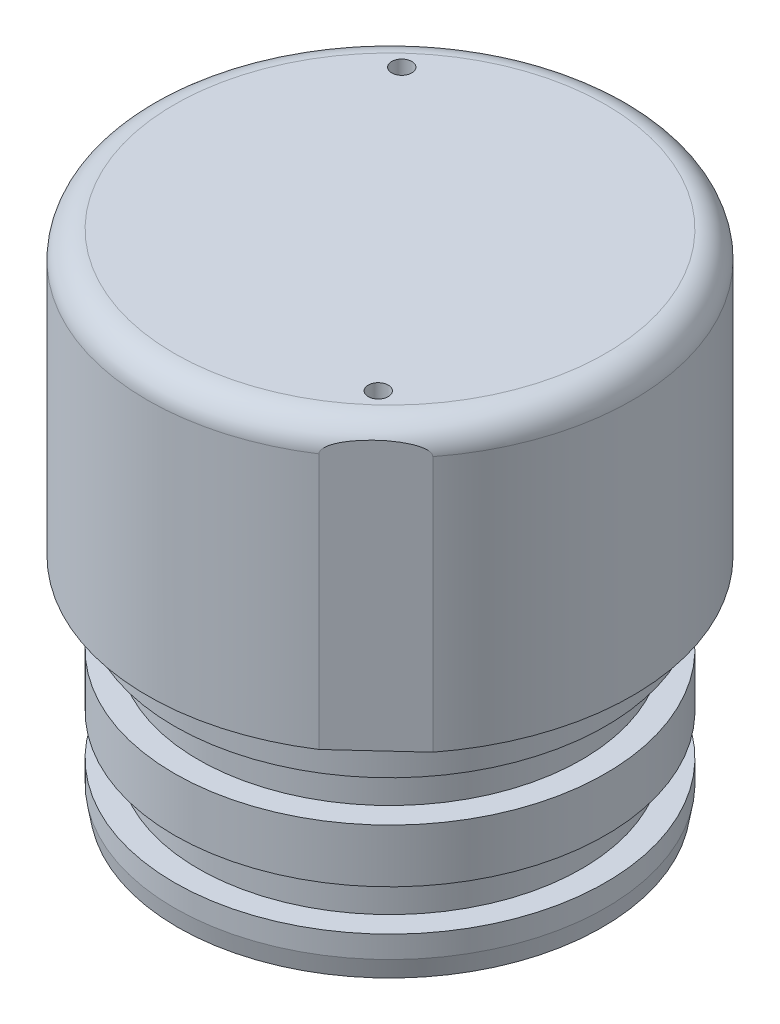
ISO-10303-21;
HEADER;
FILE_DESCRIPTION(('STEP AP214'),'2;1');
FILE_NAME('part.step','',(''),(''),'','','');
FILE_SCHEMA(('AUTOMOTIVE_DESIGN { 1 0 10303 214 1 1 1 1 }'));
ENDSEC;
DATA;
#1=APPLICATION_CONTEXT('core data for automotive mechanical design processes');
#2=APPLICATION_PROTOCOL_DEFINITION('international standard','automotive_design',2000,#1);
#3=PRODUCT_CONTEXT('',#1,'mechanical');
#4=PRODUCT('Part','Part','',(#3));
#5=PRODUCT_RELATED_PRODUCT_CATEGORY('part','',(#4));
#6=PRODUCT_DEFINITION_FORMATION('','',#4);
#7=PRODUCT_DEFINITION_CONTEXT('part definition',#1,'design');
#8=PRODUCT_DEFINITION('design','',#6,#7);
#9=PRODUCT_DEFINITION_SHAPE('','',#8);
#10=(LENGTH_UNIT() NAMED_UNIT(*) SI_UNIT(.MILLI.,.METRE.));
#11=(NAMED_UNIT(*) PLANE_ANGLE_UNIT() SI_UNIT($,.RADIAN.));
#12=(NAMED_UNIT(*) SI_UNIT($,.STERADIAN.) SOLID_ANGLE_UNIT());
#13=UNCERTAINTY_MEASURE_WITH_UNIT(LENGTH_MEASURE(1.E-05),#10,'distance_accuracy_value','');
#14=(GEOMETRIC_REPRESENTATION_CONTEXT(3) GLOBAL_UNCERTAINTY_ASSIGNED_CONTEXT((#13)) GLOBAL_UNIT_ASSIGNED_CONTEXT((#10,
#11,#12)) REPRESENTATION_CONTEXT('',''));
#15=CARTESIAN_POINT('',(0.,0.,0.));
#16=DIRECTION('',(0.,0.,1.));
#17=DIRECTION('',(1.,0.,0.));
#18=AXIS2_PLACEMENT_3D('',#15,#16,#17);
#19=CARTESIAN_POINT('',(0.,0.,0.));
#20=DIRECTION('',(0.,1.,0.));
#21=DIRECTION('',(0.,0.,1.));
#22=AXIS2_PLACEMENT_3D('',#19,#20,#21);
#23=PLANE('',#22);
#24=CARTESIAN_POINT('',(0.,0.,0.));
#25=DIRECTION('',(0.,1.,0.));
#26=DIRECTION('',(0.,0.,1.));
#27=AXIS2_PLACEMENT_3D('',#24,#25,#26);
#28=CIRCLE('',#27,25.4);
#29=CARTESIAN_POINT('',(0.,0.,25.4));
#30=VERTEX_POINT('',#29);
#31=EDGE_CURVE('E266',#30,#30,#28,.T.);
#32=ORIENTED_EDGE('',*,*,#31,.T.);
#33=EDGE_LOOP('',(#32));
#34=FACE_BOUND('',#33,.T.);
#35=DIRECTION('',(-0.736097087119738,0.,0.676875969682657));
#36=VECTOR('',#35,1.);
#37=CARTESIAN_POINT('',(-19.0730956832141,0.,-20.7418357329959));
#38=LINE('',#37,#36);
#39=CARTESIAN_POINT('',(-15.5796269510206,0.,-23.9542449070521));
#40=VERTEX_POINT('',#39);
#41=CARTESIAN_POINT('',(-22.5665644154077,0.,-17.5294265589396));
#42=VERTEX_POINT('',#41);
#43=EDGE_CURVE('E175',#40,#42,#38,.T.);
#44=ORIENTED_EDGE('',*,*,#43,.F.);
#45=CARTESIAN_POINT('',(0.,0.,0.));
#46=DIRECTION('',(0.,1.,0.));
#47=DIRECTION('',(0.,0.,1.));
#48=AXIS2_PLACEMENT_3D('',#45,#46,#47);
#49=CIRCLE('',#48,28.575);
#50=CARTESIAN_POINT('',(22.5665644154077,0.,17.5294265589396));
#51=VERTEX_POINT('',#50);
#52=EDGE_CURVE('E269',#51,#40,#49,.T.);
#53=ORIENTED_EDGE('',*,*,#52,.F.);
#54=DIRECTION('',(0.736097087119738,0.,-0.676875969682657));
#55=VECTOR('',#54,1.);
#56=CARTESIAN_POINT('',(19.0730956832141,0.,20.7418357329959));
#57=LINE('',#56,#55);
#58=CARTESIAN_POINT('',(15.5796269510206,0.,23.9542449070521));
#59=VERTEX_POINT('',#58);
#60=EDGE_CURVE('E344',#59,#51,#57,.T.);
#61=ORIENTED_EDGE('',*,*,#60,.F.);
#62=EDGE_CURVE('E290',#42,#59,#49,.T.);
#63=ORIENTED_EDGE('',*,*,#62,.F.);
#64=EDGE_LOOP('',(#44,#53,#61,#63));
#65=FACE_BOUND('',#64,.T.);
#66=ADVANCED_FACE('F47',(#34,#65),#23,.F.);
#67=CARTESIAN_POINT('',(0.,30.1498,0.));
#68=DIRECTION('',(0.,1.,0.));
#69=DIRECTION('',(0.,0.,1.));
#70=AXIS2_PLACEMENT_3D('',#67,#68,#69);
#71=TOROIDAL_SURFACE('',#70,25.4,3.175);
#72=CARTESIAN_POINT('',(0.,33.3248,0.));
#73=DIRECTION('',(0.,1.,0.));
#74=DIRECTION('',(0.,0.,1.));
#75=AXIS2_PLACEMENT_3D('',#72,#73,#74);
#76=CIRCLE('',#75,25.4);
#77=CARTESIAN_POINT('',(0.,33.3248,25.4));
#78=VERTEX_POINT('',#77);
#79=EDGE_CURVE('E315',#78,#78,#76,.T.);
#80=ORIENTED_EDGE('',*,*,#79,.F.);
#81=EDGE_LOOP('',(#80));
#82=FACE_BOUND('',#81,.T.);
#83=CARTESIAN_POINT('',(0.,30.1498,0.));
#84=DIRECTION('',(0.,1.,0.));
#85=DIRECTION('',(0.,0.,1.));
#86=AXIS2_PLACEMENT_3D('',#83,#84,#85);
#87=CIRCLE('',#86,28.575);
#88=CARTESIAN_POINT('',(-15.5796269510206,30.1498000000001,-23.9542449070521));
#89=VERTEX_POINT('',#88);
#90=CARTESIAN_POINT('',(-0.531127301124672,30.1498,-28.5700635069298));
#91=VERTEX_POINT('',#90);
#92=EDGE_CURVE('E317',#89,#91,#87,.F.);
#93=ORIENTED_EDGE('',*,*,#92,.F.);
#94=CARTESIAN_POINT('',(-15.5817128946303,30.0951413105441,-23.952326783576));
#95=CARTESIAN_POINT('',(-15.5792110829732,30.1268458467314,-23.9546273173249));
#96=CARTESIAN_POINT('',(-15.5789577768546,30.1588034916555,-23.9548602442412));
#97=CARTESIAN_POINT('',(-15.5825959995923,30.2219737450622,-23.9515147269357));
#98=CARTESIAN_POINT('',(-15.5864466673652,30.2531905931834,-23.9479738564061));
#99=CARTESIAN_POINT('',(-15.5978925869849,30.3142250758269,-23.9374487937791));
#100=CARTESIAN_POINT('',(-15.6054798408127,30.3440455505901,-23.9304719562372));
#101=CARTESIAN_POINT('',(-15.62373561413,30.4019326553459,-23.913684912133));
#102=CARTESIAN_POINT('',(-15.634411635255,30.4299948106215,-23.9038678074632));
#103=CARTESIAN_POINT('',(-15.666442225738,30.5029551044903,-23.8744141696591));
#104=CARTESIAN_POINT('',(-15.6900628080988,30.5460059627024,-23.8526939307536));
#105=CARTESIAN_POINT('',(-15.741756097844,30.6268476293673,-23.8051595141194));
#106=CARTESIAN_POINT('',(-15.7698431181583,30.6646207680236,-23.779332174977));
#107=CARTESIAN_POINT('',(-15.8282739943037,30.7349283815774,-23.7256022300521));
#108=CARTESIAN_POINT('',(-15.858557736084,30.767556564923,-23.6977549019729));
#109=CARTESIAN_POINT('',(-15.9210431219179,30.8292576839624,-23.6402966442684));
#110=CARTESIAN_POINT('',(-15.9532466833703,30.8583269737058,-23.6106839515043));
#111=CARTESIAN_POINT('',(-16.051944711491,30.9411685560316,-23.5199264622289));
#112=CARTESIAN_POINT('',(-16.1204550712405,30.9904952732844,-23.4569279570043));
#113=CARTESIAN_POINT('',(-16.2454564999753,31.0709346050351,-23.3419832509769));
#114=CARTESIAN_POINT('',(-16.3014025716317,31.1036894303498,-23.2905382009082));
#115=CARTESIAN_POINT('',(-16.4145724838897,31.1648718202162,-23.1864731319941));
#116=CARTESIAN_POINT('',(-16.4717965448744,31.1932986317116,-23.1338529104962));
#117=CARTESIAN_POINT('',(-16.6450073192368,31.2733261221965,-22.9745774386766));
#118=CARTESIAN_POINT('',(-16.7623329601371,31.3195531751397,-22.8666909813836));
#119=CARTESIAN_POINT('',(-16.9996306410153,31.4016796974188,-22.6484845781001));
#120=CARTESIAN_POINT('',(-17.1196146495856,31.4375127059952,-22.5381536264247));
#121=CARTESIAN_POINT('',(-17.360652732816,31.5006063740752,-22.3165077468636));
#122=CARTESIAN_POINT('',(-17.4817055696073,31.5278758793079,-22.2051939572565));
#123=CARTESIAN_POINT('',(-17.7387193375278,31.578037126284,-21.9688576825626));
#124=CARTESIAN_POINT('',(-17.8747720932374,31.6000471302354,-21.8437507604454));
#125=CARTESIAN_POINT('',(-18.1474502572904,31.6363572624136,-21.5930103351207));
#126=CARTESIAN_POINT('',(-18.2840757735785,31.6506558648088,-21.467376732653));
#127=CARTESIAN_POINT('',(-18.5578202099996,31.6722442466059,-21.215655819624));
#128=CARTESIAN_POINT('',(-18.6949395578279,31.6795238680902,-21.0895681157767));
#129=CARTESIAN_POINT('',(-18.9692981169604,31.6873726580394,-20.8372824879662));
#130=CARTESIAN_POINT('',(-19.1065373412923,31.6879409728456,-20.7110845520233));
#131=CARTESIAN_POINT('',(-19.3801198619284,31.6824066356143,-20.4595125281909));
#132=CARTESIAN_POINT('',(-19.516463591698,31.6763440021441,-20.3341380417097));
#133=CARTESIAN_POINT('',(-19.7888760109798,31.6573402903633,-20.0836419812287));
#134=CARTESIAN_POINT('',(-19.9249447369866,31.644400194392,-19.9585203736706));
#135=CARTESIAN_POINT('',(-20.1963911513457,31.6110517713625,-19.7089126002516));
#136=CARTESIAN_POINT('',(-20.331769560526,31.5906544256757,-19.5844257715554));
#137=CARTESIAN_POINT('',(-20.6016643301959,31.5413398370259,-19.3362448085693));
#138=CARTESIAN_POINT('',(-20.7361809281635,31.5124250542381,-19.2125504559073));
#139=CARTESIAN_POINT('',(-20.9709106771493,31.4526842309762,-18.9967053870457));
#140=CARTESIAN_POINT('',(-21.0714264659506,31.4240759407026,-18.904276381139));
#141=CARTESIAN_POINT('',(-21.2713724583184,31.3597670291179,-18.7204166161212));
#142=CARTESIAN_POINT('',(-21.370801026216,31.3240569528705,-18.6289873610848));
#143=CARTESIAN_POINT('',(-21.5764714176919,31.2402462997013,-18.4398637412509));
#144=CARTESIAN_POINT('',(-21.6825416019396,31.1913311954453,-18.3423272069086));
#145=CARTESIAN_POINT('',(-21.8383726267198,31.1071934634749,-18.1990332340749));
#146=CARTESIAN_POINT('',(-21.8897171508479,31.0773911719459,-18.1518195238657));
#147=CARTESIAN_POINT('',(-21.9908870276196,31.0133899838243,-18.0587890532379));
#148=CARTESIAN_POINT('',(-22.0407133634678,30.9791940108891,-18.0129713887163));
#149=CARTESIAN_POINT('',(-22.1272225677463,30.9135727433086,-17.9334220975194));
#150=CARTESIAN_POINT('',(-22.1643514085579,30.8832400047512,-17.8992803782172));
#151=CARTESIAN_POINT('',(-22.2367405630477,30.818481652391,-17.8327151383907));
#152=CARTESIAN_POINT('',(-22.271997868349,30.784049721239,-17.8002943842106));
#153=CARTESIAN_POINT('',(-22.3399297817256,30.7098675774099,-17.7378277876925));
#154=CARTESIAN_POINT('',(-22.3725773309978,30.6700708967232,-17.7078068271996));
#155=CARTESIAN_POINT('',(-22.433160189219,30.5842733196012,-17.652098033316));
#156=CARTESIAN_POINT('',(-22.4611089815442,30.5382908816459,-17.6263978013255));
#157=CARTESIAN_POINT('',(-22.4990889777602,30.4602778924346,-17.5914734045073));
#158=CARTESIAN_POINT('',(-22.5116964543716,30.4305820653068,-17.5798802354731));
#159=CARTESIAN_POINT('',(-22.5335069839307,30.3690394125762,-17.5598244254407));
#160=CARTESIAN_POINT('',(-22.5427217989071,30.3372004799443,-17.5513509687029));
#161=CARTESIAN_POINT('',(-22.5570990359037,30.2708914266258,-17.5381304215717));
#162=CARTESIAN_POINT('',(-22.5621462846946,30.2363736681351,-17.5334892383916));
#163=CARTESIAN_POINT('',(-22.5672818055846,30.1661955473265,-17.5287668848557));
#164=CARTESIAN_POINT('',(-22.5672998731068,30.1305259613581,-17.5287502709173));
#165=CARTESIAN_POINT('',(-22.564478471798,30.0951413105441,-17.5313446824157));
#166=B_SPLINE_CURVE_WITH_KNOTS('',3,(#94,#95,#96,#97,#98,#99,#100,#101,#102,#103,#104,#105,#106,
#107,#108,#109,#110,#111,#112,#113,#114,#115,#116,#117,#118,#119,#120,#121,#122,#123,#124,#125,
#126,#127,#128,#129,#130,#131,#132,#133,#134,#135,#136,#137,#138,#139,#140,#141,#142,#143,#144,
#145,#146,#147,#148,#149,#150,#151,#152,#153,#154,#155,#156,#157,#158,#159,#160,#161,#162,#163,
#164,#165),.UNSPECIFIED.,.F.,.F.,(4,2,2,2,2,2,2,2,2,2,2,2,2,2,2,2,2,2,2,2,2,2,2,2,2,2,2,2,2,2,2,
2,2,2,2,4),(0.,0.0954121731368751,0.189883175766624,0.284152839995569,0.378653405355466,
0.538804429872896,0.699479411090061,0.856764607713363,1.01420961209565,1.32947221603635,
1.57764159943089,1.82585411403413,2.3231658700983,2.82359073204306,3.32349696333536,
3.8817176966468,4.4400488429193,4.99918680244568,5.55839588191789,6.11424859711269,
6.67002193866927,7.22498013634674,7.77977819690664,8.19817248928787,8.61712758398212,
9.07299893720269,9.3004461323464,9.52774275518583,9.70417258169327,9.88087791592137,
10.0592260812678,10.2370533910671,10.33959720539,10.4417820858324,10.5467044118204,
10.65309132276),.UNSPECIFIED.);
#167=CARTESIAN_POINT('',(-22.5665644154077,30.1498,-17.5294265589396));
#168=VERTEX_POINT('',#167);
#169=EDGE_CURVE('E159',#89,#168,#166,.T.);
#170=ORIENTED_EDGE('',*,*,#169,.T.);
#171=CARTESIAN_POINT('',(15.5796269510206,30.1498000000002,23.9542449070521));
#172=VERTEX_POINT('',#171);
#173=EDGE_CURVE('E324',#172,#168,#87,.F.);
#174=ORIENTED_EDGE('',*,*,#173,.F.);
#175=CARTESIAN_POINT('',(15.5817128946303,30.0951413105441,23.952326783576));
#176=CARTESIAN_POINT('',(15.5792110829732,30.1268458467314,23.9546273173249));
#177=CARTESIAN_POINT('',(15.5789577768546,30.1588034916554,23.9548602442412));
#178=CARTESIAN_POINT('',(15.5825959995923,30.2219737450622,23.9515147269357));
#179=CARTESIAN_POINT('',(15.5864466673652,30.2531905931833,23.9479738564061));
#180=CARTESIAN_POINT('',(15.5978925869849,30.3142250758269,23.9374487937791));
#181=CARTESIAN_POINT('',(15.6054798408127,30.3440455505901,23.9304719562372));
#182=CARTESIAN_POINT('',(15.62373561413,30.4019326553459,23.913684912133));
#183=CARTESIAN_POINT('',(15.634411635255,30.4299948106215,23.9038678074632));
#184=CARTESIAN_POINT('',(15.666442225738,30.5029551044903,23.8744141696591));
#185=CARTESIAN_POINT('',(15.6900628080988,30.5460059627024,23.8526939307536));
#186=CARTESIAN_POINT('',(15.741756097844,30.6268476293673,23.8051595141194));
#187=CARTESIAN_POINT('',(15.7698431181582,30.6646207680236,23.7793321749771));
#188=CARTESIAN_POINT('',(15.8282739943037,30.7349283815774,23.7256022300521));
#189=CARTESIAN_POINT('',(15.858557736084,30.767556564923,23.6977549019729));
#190=CARTESIAN_POINT('',(15.9210431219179,30.8292576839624,23.6402966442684));
#191=CARTESIAN_POINT('',(15.9532466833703,30.8583269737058,23.6106839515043));
#192=CARTESIAN_POINT('',(16.051944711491,30.9411685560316,23.5199264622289));
#193=CARTESIAN_POINT('',(16.1204550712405,30.9904952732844,23.4569279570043));
#194=CARTESIAN_POINT('',(16.2454564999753,31.0709346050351,23.3419832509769));
#195=CARTESIAN_POINT('',(16.3014025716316,31.1036894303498,23.2905382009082));
#196=CARTESIAN_POINT('',(16.4145724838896,31.1648718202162,23.1864731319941));
#197=CARTESIAN_POINT('',(16.4717965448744,31.1932986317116,23.1338529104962));
#198=CARTESIAN_POINT('',(16.6450073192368,31.2733261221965,22.9745774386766));
#199=CARTESIAN_POINT('',(16.7623329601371,31.3195531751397,22.8666909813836));
#200=CARTESIAN_POINT('',(16.9996306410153,31.4016796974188,22.6484845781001));
#201=CARTESIAN_POINT('',(17.1196146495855,31.4375127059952,22.5381536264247));
#202=CARTESIAN_POINT('',(17.3606527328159,31.5006063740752,22.3165077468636));
#203=CARTESIAN_POINT('',(17.4817055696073,31.5278758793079,22.2051939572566));
#204=CARTESIAN_POINT('',(17.7387193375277,31.578037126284,21.9688576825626));
#205=CARTESIAN_POINT('',(17.8747720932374,31.6000471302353,21.8437507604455));
#206=CARTESIAN_POINT('',(18.1474502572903,31.6363572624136,21.5930103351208));
#207=CARTESIAN_POINT('',(18.2840757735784,31.6506558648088,21.467376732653));
#208=CARTESIAN_POINT('',(18.5578202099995,31.6722442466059,21.2156558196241));
#209=CARTESIAN_POINT('',(18.6949395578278,31.6795238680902,21.0895681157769));
#210=CARTESIAN_POINT('',(18.9692981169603,31.6873726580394,20.8372824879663));
#211=CARTESIAN_POINT('',(19.1065373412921,31.6879409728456,20.7110845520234));
#212=CARTESIAN_POINT('',(19.3801198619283,31.6824066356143,20.459512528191));
#213=CARTESIAN_POINT('',(19.5164635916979,31.6763440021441,20.3341380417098));
#214=CARTESIAN_POINT('',(19.7888760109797,31.6573402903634,20.0836419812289));
#215=CARTESIAN_POINT('',(19.9249447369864,31.644400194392,19.9585203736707));
#216=CARTESIAN_POINT('',(20.1963911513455,31.6110517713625,19.7089126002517));
#217=CARTESIAN_POINT('',(20.3317695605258,31.5906544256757,19.5844257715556));
#218=CARTESIAN_POINT('',(20.6016643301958,31.541339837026,19.3362448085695));
#219=CARTESIAN_POINT('',(20.7361809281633,31.5124250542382,19.2125504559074));
#220=CARTESIAN_POINT('',(20.9709106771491,31.4526842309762,18.9967053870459));
#221=CARTESIAN_POINT('',(21.0714264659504,31.4240759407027,18.9042763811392));
#222=CARTESIAN_POINT('',(21.2713724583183,31.3597670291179,18.7204166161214));
#223=CARTESIAN_POINT('',(21.3708010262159,31.3240569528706,18.6289873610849));
#224=CARTESIAN_POINT('',(21.5764714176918,31.2402462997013,18.439863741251));
#225=CARTESIAN_POINT('',(21.6825416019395,31.1913311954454,18.3423272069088));
#226=CARTESIAN_POINT('',(21.8383726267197,31.107193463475,18.199033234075));
#227=CARTESIAN_POINT('',(21.8897171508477,31.0773911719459,18.1518195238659));
#228=CARTESIAN_POINT('',(21.9908870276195,31.0133899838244,18.058789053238));
#229=CARTESIAN_POINT('',(22.0407133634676,30.9791940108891,18.0129713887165));
#230=CARTESIAN_POINT('',(22.1272225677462,30.9135727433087,17.9334220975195));
#231=CARTESIAN_POINT('',(22.1643514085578,30.8832400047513,17.8992803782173));
#232=CARTESIAN_POINT('',(22.2367405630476,30.8184816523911,17.8327151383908));
#233=CARTESIAN_POINT('',(22.2719978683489,30.7840497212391,17.8002943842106));
#234=CARTESIAN_POINT('',(22.3399297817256,30.70986757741,17.7378277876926));
#235=CARTESIAN_POINT('',(22.3725773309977,30.6700708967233,17.7078068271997));
#236=CARTESIAN_POINT('',(22.433160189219,30.5842733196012,17.6520980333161));
#237=CARTESIAN_POINT('',(22.4611089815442,30.5382908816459,17.6263978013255));
#238=CARTESIAN_POINT('',(22.4990889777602,30.4602778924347,17.5914734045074));
#239=CARTESIAN_POINT('',(22.5116964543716,30.4305820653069,17.5798802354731));
#240=CARTESIAN_POINT('',(22.5335069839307,30.3690394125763,17.5598244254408));
#241=CARTESIAN_POINT('',(22.542721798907,30.3372004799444,17.5513509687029));
#242=CARTESIAN_POINT('',(22.5570990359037,30.2708914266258,17.5381304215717));
#243=CARTESIAN_POINT('',(22.5621462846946,30.2363736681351,17.5334892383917));
#244=CARTESIAN_POINT('',(22.5672818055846,30.1661955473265,17.5287668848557));
#245=CARTESIAN_POINT('',(22.5672998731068,30.1305259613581,17.5287502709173));
#246=CARTESIAN_POINT('',(22.564478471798,30.0951413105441,17.5313446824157));
#247=B_SPLINE_CURVE_WITH_KNOTS('',3,(#175,#176,#177,#178,#179,#180,#181,#182,#183,#184,#185,
#186,#187,#188,#189,#190,#191,#192,#193,#194,#195,#196,#197,#198,#199,#200,#201,#202,#203,#204,
#205,#206,#207,#208,#209,#210,#211,#212,#213,#214,#215,#216,#217,#218,#219,#220,#221,#222,#223,
#224,#225,#226,#227,#228,#229,#230,#231,#232,#233,#234,#235,#236,#237,#238,#239,#240,#241,#242,
#243,#244,#245,#246),.UNSPECIFIED.,.F.,.F.,(4,2,2,2,2,2,2,2,2,2,2,2,2,2,2,2,2,2,2,2,2,2,2,2,2,2,
2,2,2,2,2,2,2,2,2,4),(0.,0.0954121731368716,0.189883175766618,0.28415283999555,
0.378653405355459,0.538804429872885,0.699479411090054,0.856764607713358,1.01420961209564,
1.32947221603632,1.57764159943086,1.82585411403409,2.32316587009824,2.82359073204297,
3.32349696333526,3.88171769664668,4.44004884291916,4.99918680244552,5.5583958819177,
6.11424859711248,6.67002193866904,7.22498013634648,7.77977819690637,8.19817248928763,
8.61712758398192,9.07299893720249,9.3004461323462,9.52774275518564,9.7041725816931,
9.88087791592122,10.0592260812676,10.237053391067,10.3395972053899,10.4417820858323,
10.5467044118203,10.65309132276),.UNSPECIFIED.);
#248=CARTESIAN_POINT('',(22.5665644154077,30.1498,17.5294265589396));
#249=VERTEX_POINT('',#248);
#250=EDGE_CURVE('E52',#172,#249,#247,.T.);
#251=ORIENTED_EDGE('',*,*,#250,.T.);
#252=CARTESIAN_POINT('',(0.531127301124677,30.1498,-28.5700635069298));
#253=VERTEX_POINT('',#252);
#254=EDGE_CURVE('E321',#253,#249,#87,.F.);
#255=ORIENTED_EDGE('',*,*,#254,.F.);
#256=CARTESIAN_POINT('',(-0.531127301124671,30.1498,-28.5700635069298));
#257=CARTESIAN_POINT('',(-0.354084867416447,30.1582666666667,-28.5733375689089));
#258=CARTESIAN_POINT('',(-0.177042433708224,30.1625,-28.5749745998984));
#259=CARTESIAN_POINT('',(0.177042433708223,30.1625,-28.5749745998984));
#260=CARTESIAN_POINT('',(0.354084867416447,30.1582666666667,-28.5733375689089));
#261=CARTESIAN_POINT('',(0.531127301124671,30.1498,-28.5700635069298));
#262=B_SPLINE_CURVE_WITH_KNOTS('',3,(#256,#257,#258,#259,#260,#261),.UNSPECIFIED.,.F.,.F.,(4,2,
4),(0.,0.531301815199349,1.0626036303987),.UNSPECIFIED.);
#263=EDGE_CURVE('E323',#91,#253,#262,.T.);
#264=ORIENTED_EDGE('',*,*,#263,.F.);
#265=EDGE_LOOP('',(#93,#170,#174,#251,#255,#264));
#266=FACE_BOUND('',#265,.T.);
#267=ADVANCED_FACE('F49',(#82,#266),#71,.T.);
#268=CARTESIAN_POINT('',(0.,33.3248,0.));
#269=DIRECTION('',(0.,-1.,0.));
#270=DIRECTION('',(0.,0.,-1.));
#271=AXIS2_PLACEMENT_3D('',#268,#269,#270);
#272=CYLINDRICAL_SURFACE('',#271,28.575);
#273=DIRECTION('',(0.,-1.,0.));
#274=VECTOR('',#273,1.);
#275=CARTESIAN_POINT('',(-15.5796269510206,199.899972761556,-23.9542449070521));
#276=LINE('',#275,#274);
#277=EDGE_CURVE('E62',#89,#40,#276,.T.);
#278=ORIENTED_EDGE('',*,*,#277,.F.);
#279=ORIENTED_EDGE('',*,*,#92,.T.);
#280=CARTESIAN_POINT('',(0.,30.1625,-28.575));
#281=CARTESIAN_POINT('',(-0.300085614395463,30.1625019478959,-28.5750014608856));
#282=CARTESIAN_POINT('',(-0.600145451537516,30.150335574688,-28.5702629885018));
#283=CARTESIAN_POINT('',(-1.1979826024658,30.101805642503,-28.551442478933));
#284=CARTESIAN_POINT('',(-1.49576016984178,30.065444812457,-28.5373614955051));
#285=CARTESIAN_POINT('',(-2.0867849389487,29.9689116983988,-28.5002390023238));
#286=CARTESIAN_POINT('',(-2.38003312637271,29.9087446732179,-28.477199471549));
#287=CARTESIAN_POINT('',(-2.95999972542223,29.7651903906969,-28.4227702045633));
#288=CARTESIAN_POINT('',(-3.24671791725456,29.6818023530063,-28.3913801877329));
#289=CARTESIAN_POINT('',(-3.81104373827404,29.4927943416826,-28.3211448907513));
#290=CARTESIAN_POINT('',(-4.08867058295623,29.3872252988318,-28.2823167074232));
#291=CARTESIAN_POINT('',(-4.63385527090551,29.1545986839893,-28.1981227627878));
#292=CARTESIAN_POINT('',(-4.90140933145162,29.0275331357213,-28.1527545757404));
#293=CARTESIAN_POINT('',(-5.42477403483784,28.7529282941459,-28.0566079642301));
#294=CARTESIAN_POINT('',(-5.68058451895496,28.6053887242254,-28.0058294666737));
#295=CARTESIAN_POINT('',(-6.17906364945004,28.2908707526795,-27.9000847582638));
#296=CARTESIAN_POINT('',(-6.42173134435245,28.1238909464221,-27.8451182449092));
#297=CARTESIAN_POINT('',(-6.90221905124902,27.7643949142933,-27.7300105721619));
#298=CARTESIAN_POINT('',(-7.13944006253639,27.5711160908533,-27.6697498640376));
#299=CARTESIAN_POINT('',(-7.59692811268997,27.1658931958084,-27.5476563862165));
#300=CARTESIAN_POINT('',(-7.81719479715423,26.9539487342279,-27.4858235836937));
#301=CARTESIAN_POINT('',(-8.2396079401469,26.512563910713,-27.3621625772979));
#302=CARTESIAN_POINT('',(-8.44174817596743,26.2831175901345,-27.3003343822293));
#303=CARTESIAN_POINT('',(-8.82662744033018,25.8080878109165,-27.1783376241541));
#304=CARTESIAN_POINT('',(-9.00936691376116,25.5625047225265,-27.1181690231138));
#305=CARTESIAN_POINT('',(-9.36153094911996,25.045928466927,-26.9986737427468));
#306=CARTESIAN_POINT('',(-9.53007548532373,24.7743015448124,-26.9394882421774));
#307=CARTESIAN_POINT('',(-9.84348993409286,24.2167768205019,-26.8265555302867));
#308=CARTESIAN_POINT('',(-9.9883693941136,23.930884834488,-26.7728061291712));
#309=CARTESIAN_POINT('',(-10.2532705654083,23.3466222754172,-26.6724790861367));
#310=CARTESIAN_POINT('',(-10.3732952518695,23.0482532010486,-26.6259005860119));
#311=CARTESIAN_POINT('',(-10.587329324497,22.441120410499,-26.5415209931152));
#312=CARTESIAN_POINT('',(-10.6813403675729,22.1323573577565,-26.5037193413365));
#313=CARTESIAN_POINT('',(-10.8388318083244,21.5203906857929,-26.4396910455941));
#314=CARTESIAN_POINT('',(-10.9034605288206,21.2175277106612,-26.4130331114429));
#315=CARTESIAN_POINT('',(-11.0072763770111,20.6067484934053,-26.3699386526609));
#316=CARTESIAN_POINT('',(-11.0464642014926,20.2988323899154,-26.3535018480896));
#317=CARTESIAN_POINT('',(-11.0989327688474,19.6805340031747,-26.3314475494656));
#318=CARTESIAN_POINT('',(-11.1122236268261,19.370152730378,-26.3258258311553));
#319=CARTESIAN_POINT('',(-11.1127677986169,18.7493700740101,-26.3255963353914));
#320=CARTESIAN_POINT('',(-11.1000222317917,18.4389686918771,-26.3309880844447));
#321=CARTESIAN_POINT('',(-11.050330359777,17.8408906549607,-26.3518780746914));
#322=CARTESIAN_POINT('',(-11.0150171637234,17.5530525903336,-26.3666940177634));
#323=CARTESIAN_POINT('',(-10.9221439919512,16.9816163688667,-26.4053010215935));
#324=CARTESIAN_POINT('',(-10.8645851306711,16.6980180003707,-26.4290916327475));
#325=CARTESIAN_POINT('',(-10.7277667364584,16.1369116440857,-26.4849220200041));
#326=CARTESIAN_POINT('',(-10.6485047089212,15.8594043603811,-26.5169627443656));
#327=CARTESIAN_POINT('',(-10.468986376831,15.3122339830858,-26.5883483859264));
#328=CARTESIAN_POINT('',(-10.3687293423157,15.0425711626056,-26.6276935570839));
#329=CARTESIAN_POINT('',(-10.1458746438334,14.5074768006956,-26.7134118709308));
#330=CARTESIAN_POINT('',(-10.02287880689,14.2422308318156,-26.7599072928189));
#331=CARTESIAN_POINT('',(-9.75678710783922,13.7229064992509,-26.858068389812));
#332=CARTESIAN_POINT('',(-9.61368389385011,13.4688322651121,-26.9097359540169));
#333=CARTESIAN_POINT('',(-9.30835793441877,12.9732537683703,-27.0168700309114));
#334=CARTESIAN_POINT('',(-9.14613305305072,12.7317509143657,-27.0723369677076));
#335=CARTESIAN_POINT('',(-8.80355729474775,12.2625540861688,-27.1856681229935));
#336=CARTESIAN_POINT('',(-8.62320553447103,12.0348607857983,-27.2435324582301));
#337=CARTESIAN_POINT('',(-8.23157561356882,11.5783374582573,-27.3645169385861));
#338=CARTESIAN_POINT('',(-8.01900089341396,11.3506380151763,-27.4277123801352));
#339=CARTESIAN_POINT('',(-7.57550101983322,10.9138911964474,-27.5535026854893));
#340=CARTESIAN_POINT('',(-7.34458322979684,10.7048364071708,-27.6160977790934));
#341=CARTESIAN_POINT('',(-6.8655078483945,10.3064557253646,-27.7390809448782));
#342=CARTESIAN_POINT('',(-6.61733983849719,10.117141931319,-27.799467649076));
#343=CARTESIAN_POINT('',(-6.10543943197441,9.75975425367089,-27.916359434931));
#344=CARTESIAN_POINT('',(-5.8417134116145,9.59167175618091,-27.9728660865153));
#345=CARTESIAN_POINT('',(-5.29530127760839,9.27508721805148,-28.0814774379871));
#346=CARTESIAN_POINT('',(-5.01235893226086,9.12699316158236,-28.1334843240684));
#347=CARTESIAN_POINT('',(-4.4337605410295,8.855316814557,-28.2304520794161));
#348=CARTESIAN_POINT('',(-4.13810423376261,8.73173502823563,-28.2754128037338));
#349=CARTESIAN_POINT('',(-3.53630462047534,8.51031507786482,-28.3569626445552));
#350=CARTESIAN_POINT('',(-3.23016542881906,8.41246694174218,-28.3935550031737));
#351=CARTESIAN_POINT('',(-2.60964328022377,8.24348355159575,-28.4572948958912));
#352=CARTESIAN_POINT('',(-2.29526086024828,8.17234656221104,-28.4844430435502));
#353=CARTESIAN_POINT('',(-1.67875195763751,8.06082518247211,-28.5272228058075));
#354=CARTESIAN_POINT('',(-1.37693727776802,8.01892969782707,-28.5434186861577));
#355=CARTESIAN_POINT('',(-0.770529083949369,7.96006188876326,-28.5662205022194));
#356=CARTESIAN_POINT('',(-0.465935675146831,7.94308862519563,-28.5728267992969));
#357=CARTESIAN_POINT('',(0.143604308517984,7.934248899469,-28.5762642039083));
#358=CARTESIAN_POINT('',(0.448550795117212,7.9423771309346,-28.5730973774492));
#359=CARTESIAN_POINT('',(1.05648660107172,7.98364065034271,-28.5570817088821));
#360=CARTESIAN_POINT('',(1.35947595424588,8.01677550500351,-28.5442330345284));
#361=CARTESIAN_POINT('',(1.94851837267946,8.10578239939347,-28.5099502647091));
#362=CARTESIAN_POINT('',(2.23474793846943,8.16063997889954,-28.4888998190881));
#363=CARTESIAN_POINT('',(2.80133973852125,8.29245617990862,-28.4387764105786));
#364=CARTESIAN_POINT('',(3.08170217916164,8.36941402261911,-28.4097037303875));
#365=CARTESIAN_POINT('',(3.63473571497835,8.54473959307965,-28.3442561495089));
#366=CARTESIAN_POINT('',(3.90740752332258,8.64310532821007,-28.307881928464));
#367=CARTESIAN_POINT('',(4.44353806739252,8.86047914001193,-28.2286921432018));
#368=CARTESIAN_POINT('',(4.70699325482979,8.97949506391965,-28.1858741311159));
#369=CARTESIAN_POINT('',(5.23077023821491,9.2410795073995,-28.0934597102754));
#370=CARTESIAN_POINT('',(5.49076579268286,9.38424324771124,-28.0436995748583));
#371=CARTESIAN_POINT('',(5.99790649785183,9.69048319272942,-27.939627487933));
#372=CARTESIAN_POINT('',(6.24504719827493,9.85356622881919,-27.885313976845));
#373=CARTESIAN_POINT('',(6.72509949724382,10.1985552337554,-27.7734480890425));
#374=CARTESIAN_POINT('',(6.95800882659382,10.3804641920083,-27.7158951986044));
#375=CARTESIAN_POINT('',(7.40834894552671,10.7619891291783,-27.5989334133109));
#376=CARTESIAN_POINT('',(7.62577908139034,10.9616058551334,-27.5395244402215));
#377=CARTESIAN_POINT('',(8.05714025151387,11.3904734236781,-27.4165373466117));
#378=CARTESIAN_POINT('',(8.26999777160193,11.6207974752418,-27.3529313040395));
#379=CARTESIAN_POINT('',(8.67558206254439,12.0987314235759,-27.2270084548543));
#380=CARTESIAN_POINT('',(8.86831516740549,12.3463358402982,-27.1646912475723));
#381=CARTESIAN_POINT('',(9.23257183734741,12.8575982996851,-27.0430608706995));
#382=CARTESIAN_POINT('',(9.40408394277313,13.121264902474,-26.9837493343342));
#383=CARTESIAN_POINT('',(9.72446958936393,13.6628584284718,-26.8699500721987));
#384=CARTESIAN_POINT('',(9.87335265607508,13.9407792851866,-26.8154603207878));
#385=CARTESIAN_POINT('',(10.1483662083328,14.5113502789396,-26.7126003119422));
#386=CARTESIAN_POINT('',(10.2743217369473,14.8040935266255,-26.6642778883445));
#387=CARTESIAN_POINT('',(10.5009533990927,15.4004287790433,-26.5758427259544));
#388=CARTESIAN_POINT('',(10.6016292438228,15.70402090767,-26.5357300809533));
#389=CARTESIAN_POINT('',(10.7765992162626,16.3196337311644,-26.4651552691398));
#390=CARTESIAN_POINT('',(10.8509084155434,16.6316495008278,-26.4346875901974));
#391=CARTESIAN_POINT('',(10.9723659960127,17.2617700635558,-26.384505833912));
#392=CARTESIAN_POINT('',(11.0195164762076,17.5798743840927,-26.3647909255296));
#393=CARTESIAN_POINT('',(11.0838003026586,18.1975201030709,-26.3378266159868));
#394=CARTESIAN_POINT('',(11.1027705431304,18.4968383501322,-26.3298150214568));
#395=CARTESIAN_POINT('',(11.1164448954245,19.0961209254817,-26.3240449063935));
#396=CARTESIAN_POINT('',(11.1111501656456,19.3960852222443,-26.3262858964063));
#397=CARTESIAN_POINT('',(11.076357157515,19.9943192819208,-26.3409431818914));
#398=CARTESIAN_POINT('',(11.0468613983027,20.2925892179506,-26.3533584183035));
#399=CARTESIAN_POINT('',(10.9639937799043,20.8852150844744,-26.3879418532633));
#400=CARTESIAN_POINT('',(10.9106219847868,21.1795710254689,-26.4101100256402));
#401=CARTESIAN_POINT('',(10.7828801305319,21.7518576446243,-26.4625149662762));
#402=CARTESIAN_POINT('',(10.7093252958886,22.0299999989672,-26.4924363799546));
#403=CARTESIAN_POINT('',(10.5411660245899,22.5790124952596,-26.5597937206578));
#404=CARTESIAN_POINT('',(10.4465542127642,22.849880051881,-26.5972322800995));
#405=CARTESIAN_POINT('',(10.2370928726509,23.3826083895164,-26.6785524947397));
#406=CARTESIAN_POINT('',(10.1222467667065,23.6444706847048,-26.7224330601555));
#407=CARTESIAN_POINT('',(9.87311158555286,24.1579140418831,-26.8154800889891));
#408=CARTESIAN_POINT('',(9.73881495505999,24.4094910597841,-26.8646486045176));
#409=CARTESIAN_POINT('',(9.44383576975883,24.9144466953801,-26.9698057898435));
#410=CARTESIAN_POINT('',(9.28211111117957,25.1671697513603,-27.0260204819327));
#411=CARTESIAN_POINT('',(8.93905623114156,25.6583827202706,-27.1414195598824));
#412=CARTESIAN_POINT('',(8.75771716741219,25.8968661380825,-27.2006052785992));
#413=CARTESIAN_POINT('',(8.37656770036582,26.3582356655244,-27.3203886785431));
#414=CARTESIAN_POINT('',(8.17675589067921,26.581120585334,-27.380986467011));
#415=CARTESIAN_POINT('',(7.75979264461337,27.0100719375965,-27.5020611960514));
#416=CARTESIAN_POINT('',(7.54264085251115,27.2161380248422,-27.5625381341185));
#417=CARTESIAN_POINT('',(7.07857943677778,27.6221673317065,-27.6854718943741));
#418=CARTESIAN_POINT('',(6.8306651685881,27.8210147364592,-27.7478284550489));
#419=CARTESIAN_POINT('',(6.31824141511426,28.1970454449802,-27.8689743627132));
#420=CARTESIAN_POINT('',(6.0537380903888,28.3742367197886,-27.9277650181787));
#421=CARTESIAN_POINT('',(5.50949886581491,28.7058100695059,-28.0402084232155));
#422=CARTESIAN_POINT('',(5.22975299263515,28.8601769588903,-28.0938577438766));
#423=CARTESIAN_POINT('',(4.65714609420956,29.144592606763,-28.1944334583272));
#424=CARTESIAN_POINT('',(4.3642905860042,29.2746514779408,-28.2413626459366));
#425=CARTESIAN_POINT('',(3.74477808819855,29.5182027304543,-28.330414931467));
#426=CARTESIAN_POINT('',(3.41724042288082,29.6296961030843,-28.3719054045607));
#427=CARTESIAN_POINT('',(2.75205803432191,29.821893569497,-28.4441333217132));
#428=CARTESIAN_POINT('',(2.41441247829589,29.9025951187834,-28.4748698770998));
#429=CARTESIAN_POINT('',(1.73237374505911,30.0321201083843,-28.5244868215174));
#430=CARTESIAN_POINT('',(1.38798409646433,30.0809597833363,-28.5433732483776));
#431=CARTESIAN_POINT('',(0.69571771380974,30.1461460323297,-28.5686280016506));
#432=CARTESIAN_POINT('',(0.347841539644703,30.162497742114,-28.5749983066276));
#433=CARTESIAN_POINT('',(0.,30.1625,-28.575));
#434=B_SPLINE_CURVE_WITH_KNOTS('',3,(#280,#281,#282,#283,#284,#285,#286,#287,#288,#289,#290,
#291,#292,#293,#294,#295,#296,#297,#298,#299,#300,#301,#302,#303,#304,#305,#306,#307,#308,#309,
#310,#311,#312,#313,#314,#315,#316,#317,#318,#319,#320,#321,#322,#323,#324,#325,#326,#327,#328,
#329,#330,#331,#332,#333,#334,#335,#336,#337,#338,#339,#340,#341,#342,#343,#344,#345,#346,#347,
#348,#349,#350,#351,#352,#353,#354,#355,#356,#357,#358,#359,#360,#361,#362,#363,#364,#365,#366,
#367,#368,#369,#370,#371,#372,#373,#374,#375,#376,#377,#378,#379,#380,#381,#382,#383,#384,#385,
#386,#387,#388,#389,#390,#391,#392,#393,#394,#395,#396,#397,#398,#399,#400,#401,#402,#403,#404,
#405,#406,#407,#408,#409,#410,#411,#412,#413,#414,#415,#416,#417,#418,#419,#420,#421,#422,#423,
#424,#425,#426,#427,#428,#429,#430,#431,#432,#433),.UNSPECIFIED.,.T.,.F.,(4,2,2,2,2,2,2,2,2,2,2,
2,2,2,2,2,2,2,2,2,2,2,2,2,2,2,2,2,2,2,2,2,2,2,2,2,2,2,2,2,2,2,2,2,2,2,2,2,2,2,2,2,2,2,2,2,2,2,2,
2,2,2,2,2,2,2,2,2,2,2,2,2,2,2,2,2,4),(0.,0.899929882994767,1.79975827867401,2.69938801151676,
3.59904798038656,4.496664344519,5.39461450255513,6.29257679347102,7.19060400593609,
8.12517082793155,9.05975718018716,9.99466315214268,10.9295476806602,11.9036466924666,
12.8773517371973,13.8509401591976,14.8244665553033,15.7557258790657,16.6869596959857,
17.6178297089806,18.5486597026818,19.4187621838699,20.2888210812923,21.1589800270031,
22.0291692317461,22.9163579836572,23.8038719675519,24.6914851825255,25.5791416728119,
26.531602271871,27.483682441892,28.4363427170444,29.3886152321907,30.3580686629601,
31.3275420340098,32.296639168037,33.2656733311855,34.1799289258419,35.0941500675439,
36.0081779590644,36.9221900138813,37.7977760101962,38.6733311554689,39.5488048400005,
40.4246119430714,41.3264672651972,42.2286327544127,43.1309417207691,44.0332887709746,
44.9921936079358,45.9507957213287,46.9099132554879,47.8686259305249,48.8343729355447,
49.8001309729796,50.7653360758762,51.7304665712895,52.6294052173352,53.528300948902,
54.4271031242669,55.325902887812,56.1927037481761,57.0598086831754,57.9267671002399,
58.7940631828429,59.7088464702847,60.62404387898,61.5393110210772,62.4545969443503,
63.4250313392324,64.3951074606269,65.3658261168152,66.336140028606,67.3798966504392,
68.4237395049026,69.4670500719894,70.5101956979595),.UNSPECIFIED.);
#435=EDGE_CURVE('E202',#91,#253,#434,.T.);
#436=ORIENTED_EDGE('',*,*,#435,.T.);
#437=ORIENTED_EDGE('',*,*,#254,.T.);
#438=DIRECTION('',(0.,-1.,0.));
#439=VECTOR('',#438,1.);
#440=CARTESIAN_POINT('',(22.5665644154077,211.806222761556,17.5294265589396));
#441=LINE('',#440,#439);
#442=EDGE_CURVE('E76',#249,#51,#441,.T.);
#443=ORIENTED_EDGE('',*,*,#442,.T.);
#444=ORIENTED_EDGE('',*,*,#52,.T.);
#445=EDGE_LOOP('',(#278,#279,#436,#437,#443,#444));
#446=FACE_BOUND('',#445,.T.);
#447=ADVANCED_FACE('F244',(#446),#272,.T.);
#448=CARTESIAN_POINT('',(0.,-25.4,0.));
#449=DIRECTION('',(0.,1.,0.));
#450=DIRECTION('',(0.,0.,1.));
#451=AXIS2_PLACEMENT_3D('',#448,#449,#450);
#452=CYLINDRICAL_SURFACE('',#451,25.4);
#453=CARTESIAN_POINT('',(0.,-9.525,0.));
#454=DIRECTION('',(0.,-1.,0.));
#455=DIRECTION('',(0.,0.,-1.));
#456=AXIS2_PLACEMENT_3D('',#453,#454,#455);
#457=CIRCLE('',#456,25.4);
#458=CARTESIAN_POINT('',(0.,-9.525,-25.4));
#459=VERTEX_POINT('',#458);
#460=EDGE_CURVE('E276',#459,#459,#457,.F.);
#461=ORIENTED_EDGE('',*,*,#460,.F.);
#462=EDGE_LOOP('',(#461));
#463=FACE_BOUND('',#462,.T.);
#464=CARTESIAN_POINT('',(0.,-15.8242,0.));
#465=DIRECTION('',(0.,-1.,0.));
#466=DIRECTION('',(0.,0.,-1.));
#467=AXIS2_PLACEMENT_3D('',#464,#465,#466);
#468=CIRCLE('',#467,25.4);
#469=CARTESIAN_POINT('',(0.,-15.8242,-25.4));
#470=VERTEX_POINT('',#469);
#471=EDGE_CURVE('E280',#470,#470,#468,.F.);
#472=ORIENTED_EDGE('',*,*,#471,.T.);
#473=EDGE_LOOP('',(#472));
#474=FACE_BOUND('',#473,.T.);
#475=ADVANCED_FACE('F252',(#463,#474),#452,.T.);
#476=CARTESIAN_POINT('',(0.,-15.8242,0.));
#477=DIRECTION('',(0.,-1.,0.));
#478=DIRECTION('',(0.,0.,-1.));
#479=AXIS2_PLACEMENT_3D('',#476,#477,#478);
#480=PLANE('',#479);
#481=ORIENTED_EDGE('',*,*,#471,.F.);
#482=EDGE_LOOP('',(#481));
#483=FACE_BOUND('',#482,.T.);
#484=CARTESIAN_POINT('',(0.,-15.8242,0.));
#485=DIRECTION('',(0.,-1.,0.));
#486=DIRECTION('',(0.,0.,-1.));
#487=AXIS2_PLACEMENT_3D('',#484,#485,#486);
#488=CIRCLE('',#487,22.5806);
#489=CARTESIAN_POINT('',(0.,-15.8242,-22.5806));
#490=VERTEX_POINT('',#489);
#491=EDGE_CURVE('E286',#490,#490,#488,.T.);
#492=ORIENTED_EDGE('',*,*,#491,.F.);
#493=EDGE_LOOP('',(#492));
#494=FACE_BOUND('',#493,.T.);
#495=ADVANCED_FACE('F353',(#483,#494),#480,.T.);
#496=CARTESIAN_POINT('',(0.,-20.6502,0.));
#497=DIRECTION('',(0.,-1.,0.));
#498=DIRECTION('',(0.,0.,-1.));
#499=AXIS2_PLACEMENT_3D('',#496,#497,#498);
#500=PLANE('',#499);
#501=CARTESIAN_POINT('',(0.,-20.6502,0.));
#502=DIRECTION('',(0.,-1.,0.));
#503=DIRECTION('',(0.,0.,-1.));
#504=AXIS2_PLACEMENT_3D('',#501,#502,#503);
#505=CIRCLE('',#504,25.4);
#506=CARTESIAN_POINT('',(0.,-20.6502,-25.4));
#507=VERTEX_POINT('',#506);
#508=EDGE_CURVE('E284',#507,#507,#505,.F.);
#509=ORIENTED_EDGE('',*,*,#508,.T.);
#510=EDGE_LOOP('',(#509));
#511=FACE_BOUND('',#510,.T.);
#512=CARTESIAN_POINT('',(0.,-20.6502,0.));
#513=DIRECTION('',(0.,-1.,0.));
#514=DIRECTION('',(0.,0.,-1.));
#515=AXIS2_PLACEMENT_3D('',#512,#513,#514);
#516=CIRCLE('',#515,22.5806);
#517=CARTESIAN_POINT('',(0.,-20.6502,-22.5806));
#518=VERTEX_POINT('',#517);
#519=EDGE_CURVE('E275',#518,#518,#516,.T.);
#520=ORIENTED_EDGE('',*,*,#519,.T.);
#521=EDGE_LOOP('',(#520));
#522=FACE_BOUND('',#521,.T.);
#523=ADVANCED_FACE('F459',(#511,#522),#500,.F.);
#524=CARTESIAN_POINT('',(0.,-15.8242,0.));
#525=DIRECTION('',(0.,-1.,0.));
#526=DIRECTION('',(0.,0.,-1.));
#527=AXIS2_PLACEMENT_3D('',#524,#525,#526);
#528=CYLINDRICAL_SURFACE('',#527,22.5806);
#529=ORIENTED_EDGE('',*,*,#491,.T.);
#530=EDGE_LOOP('',(#529));
#531=FACE_BOUND('',#530,.T.);
#532=ORIENTED_EDGE('',*,*,#519,.F.);
#533=EDGE_LOOP('',(#532));
#534=FACE_BOUND('',#533,.T.);
#535=ADVANCED_FACE('F398',(#531,#534),#528,.T.);
#536=CARTESIAN_POINT('',(0.,25.4,0.));
#537=DIRECTION('',(0.,-1.,0.));
#538=DIRECTION('',(0.,0.,-1.));
#539=AXIS2_PLACEMENT_3D('',#536,#537,#538);
#540=PLANE('',#539);
#541=DIRECTION('',(0.,0.,1.));
#542=VECTOR('',#541,1.);
#543=CARTESIAN_POINT('',(9.11949320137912,25.4,-28.575));
#544=LINE('',#543,#542);
#545=CARTESIAN_POINT('',(9.11949320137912,25.4,-16.7253503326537));
#546=VERTEX_POINT('',#545);
#547=CARTESIAN_POINT('',(9.11949320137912,25.4,0.));
#548=VERTEX_POINT('',#547);
#549=EDGE_CURVE('E303',#546,#548,#544,.T.);
#550=ORIENTED_EDGE('',*,*,#549,.F.);
#551=CARTESIAN_POINT('',(0.,25.4,0.));
#552=DIRECTION('',(0.,-1.,0.));
#553=DIRECTION('',(0.,0.,-1.));
#554=AXIS2_PLACEMENT_3D('',#551,#552,#553);
#555=CIRCLE('',#554,19.05);
#556=CARTESIAN_POINT('',(-9.11949320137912,25.4,-16.7253503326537));
#557=VERTEX_POINT('',#556);
#558=EDGE_CURVE('E293',#546,#557,#555,.T.);
#559=ORIENTED_EDGE('',*,*,#558,.T.);
#560=DIRECTION('',(0.,0.,1.));
#561=VECTOR('',#560,1.);
#562=CARTESIAN_POINT('',(-9.11949320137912,25.4,-28.575));
#563=LINE('',#562,#561);
#564=CARTESIAN_POINT('',(-9.11949320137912,25.4,0.));
#565=VERTEX_POINT('',#564);
#566=EDGE_CURVE('E219',#565,#557,#563,.F.);
#567=ORIENTED_EDGE('',*,*,#566,.F.);
#568=DIRECTION('',(-1.,0.,0.));
#569=VECTOR('',#568,1.);
#570=CARTESIAN_POINT('',(0.,25.4,0.));
#571=LINE('',#570,#569);
#572=EDGE_CURVE('E314',#548,#565,#571,.T.);
#573=ORIENTED_EDGE('',*,*,#572,.F.);
#574=EDGE_LOOP('',(#550,#559,#567,#573));
#575=FACE_BOUND('',#574,.T.);
#576=ADVANCED_FACE('F229',(#575),#540,.T.);
#577=CARTESIAN_POINT('',(0.,25.4,0.));
#578=DIRECTION('',(0.,-1.,0.));
#579=DIRECTION('',(0.,0.,-1.));
#580=AXIS2_PLACEMENT_3D('',#577,#578,#579);
#581=CYLINDRICAL_SURFACE('',#580,19.05);
#582=ORIENTED_EDGE('',*,*,#558,.F.);
#583=CARTESIAN_POINT('',(9.11949320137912,25.4,-16.7253503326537));
#584=CARTESIAN_POINT('',(9.19992753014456,25.2844821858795,-16.6814937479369));
#585=CARTESIAN_POINT('',(9.27823444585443,25.1673444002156,-16.6380438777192));
#586=CARTESIAN_POINT('',(9.4304800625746,24.9299313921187,-16.5522258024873));
#587=CARTESIAN_POINT('',(9.50442004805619,24.8096571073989,-16.5098572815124));
#588=CARTESIAN_POINT('',(9.7196988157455,24.4439929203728,-16.3846734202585));
#589=CARTESIAN_POINT('',(9.85437311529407,24.1939385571,-16.303847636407));
#590=CARTESIAN_POINT('',(10.1058215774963,23.6805822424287,-16.1492050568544));
#591=CARTESIAN_POINT('',(10.2224646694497,23.4172002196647,-16.075440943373));
#592=CARTESIAN_POINT('',(10.4356538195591,22.8799191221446,-15.9378709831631));
#593=CARTESIAN_POINT('',(10.5322032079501,22.6060217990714,-15.8740634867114));
#594=CARTESIAN_POINT('',(10.7046067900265,22.0474909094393,-15.7583234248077));
#595=CARTESIAN_POINT('',(10.7803372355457,21.7628041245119,-15.7064621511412));
#596=CARTESIAN_POINT('',(10.9092624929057,21.1861017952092,-15.6171912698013));
#597=CARTESIAN_POINT('',(10.9624564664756,20.8940859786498,-15.5797821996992));
#598=CARTESIAN_POINT('',(11.0452364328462,20.3062494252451,-15.5212057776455));
#599=CARTESIAN_POINT('',(11.0749122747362,20.0104475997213,-15.4999766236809));
#600=CARTESIAN_POINT('',(11.1104274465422,19.4167021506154,-15.474540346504));
#601=CARTESIAN_POINT('',(11.1162699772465,19.1187588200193,-15.4703309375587));
#602=CARTESIAN_POINT('',(11.1047113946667,18.5572911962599,-15.4786269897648));
#603=CARTESIAN_POINT('',(11.0898620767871,18.2936817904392,-15.4892975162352));
#604=CARTESIAN_POINT('',(11.0415681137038,17.7690595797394,-15.5237609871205));
#605=CARTESIAN_POINT('',(11.0081247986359,17.508046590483,-15.5475529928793));
#606=CARTESIAN_POINT('',(10.9230688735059,16.9900970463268,-15.6074264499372));
#607=CARTESIAN_POINT('',(10.8714326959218,16.7331662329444,-15.6435238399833));
#608=CARTESIAN_POINT('',(10.7506661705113,16.2252906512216,-15.7267621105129));
#609=CARTESIAN_POINT('',(10.6815350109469,15.974346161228,-15.7739035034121));
#610=CARTESIAN_POINT('',(10.5265714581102,15.4798397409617,-15.8777350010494));
#611=CARTESIAN_POINT('',(10.4407469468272,15.2362743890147,-15.9344205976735));
#612=CARTESIAN_POINT('',(10.2531644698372,14.7573913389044,-16.0557658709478));
#613=CARTESIAN_POINT('',(10.1514009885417,14.522076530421,-16.1204283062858));
#614=CARTESIAN_POINT('',(9.82333410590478,13.8298239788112,-16.3239292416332));
#615=CARTESIAN_POINT('',(9.57414150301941,13.3862224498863,-16.4723601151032));
#616=CARTESIAN_POINT('',(9.13457366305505,12.7147140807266,-16.7181633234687));
#617=CARTESIAN_POINT('',(8.9621647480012,12.473137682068,-16.8114250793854));
#618=CARTESIAN_POINT('',(8.59904822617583,12.005026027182,-17.0000197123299));
#619=CARTESIAN_POINT('',(8.4083457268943,11.7784866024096,-17.0953520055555));
#620=CARTESIAN_POINT('',(8.00920155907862,11.3410338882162,-17.2859531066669));
#621=CARTESIAN_POINT('',(7.80073773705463,11.1301407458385,-17.3812216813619));
#622=CARTESIAN_POINT('',(7.36712980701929,10.7252780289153,-17.5693976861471));
#623=CARTESIAN_POINT('',(7.14199152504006,10.53130259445,-17.662305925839));
#624=CARTESIAN_POINT('',(6.65150815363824,10.1419665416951,-17.853184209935));
#625=CARTESIAN_POINT('',(6.38441705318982,9.94856225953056,-17.9506749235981));
#626=CARTESIAN_POINT('',(5.83207627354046,9.5851264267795,-18.1376513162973));
#627=CARTESIAN_POINT('',(5.54682499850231,9.41509693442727,-18.2271362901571));
#628=CARTESIAN_POINT('',(4.95996517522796,9.10026660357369,-18.3954982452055));
#629=CARTESIAN_POINT('',(4.65836756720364,8.95544915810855,-18.4743822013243));
#630=CARTESIAN_POINT('',(4.04069049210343,8.69272906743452,-18.6192343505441));
#631=CARTESIAN_POINT('',(3.72461315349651,8.574822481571,-18.6852044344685));
#632=CARTESIAN_POINT('',(3.10795230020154,8.37647773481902,-18.7971490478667));
#633=CARTESIAN_POINT('',(2.8083420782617,8.29370362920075,-18.8443480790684));
#634=CARTESIAN_POINT('',(2.20144320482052,8.15329019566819,-18.9248463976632));
#635=CARTESIAN_POINT('',(1.89415493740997,8.09564961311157,-18.9581463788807));
#636=CARTESIAN_POINT('',(1.27481127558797,8.00643507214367,-19.0098355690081));
#637=CARTESIAN_POINT('',(0.962759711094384,7.97484119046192,-19.0282361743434));
#638=CARTESIAN_POINT('',(0.336587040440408,7.93817336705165,-19.0496011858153));
#639=CARTESIAN_POINT('',(0.022466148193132,7.93309672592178,-19.0525671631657));
#640=CARTESIAN_POINT('',(-0.566931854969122,7.94854136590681,-19.0435609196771));
#641=CARTESIAN_POINT('',(-0.842321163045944,7.96604694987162,-19.0333485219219));
#642=CARTESIAN_POINT('',(-1.39033396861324,8.02138024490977,-19.0011785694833));
#643=CARTESIAN_POINT('',(-1.66295773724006,8.05920594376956,-18.9792221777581));
#644=CARTESIAN_POINT('',(-2.20354362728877,8.15470732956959,-18.9240780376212));
#645=CARTESIAN_POINT('',(-2.47150564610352,8.21238345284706,-18.8908900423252));
#646=CARTESIAN_POINT('',(-3.00103198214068,8.34691189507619,-18.8140344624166));
#647=CARTESIAN_POINT('',(-3.26259605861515,8.42376493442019,-18.7703664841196));
#648=CARTESIAN_POINT('',(-3.778067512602,8.595920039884,-18.6734455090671));
#649=CARTESIAN_POINT('',(-4.03196612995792,8.69124235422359,-18.6201819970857));
#650=CARTESIAN_POINT('',(-4.53058281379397,8.89940903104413,-18.5051833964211));
#651=CARTESIAN_POINT('',(-4.77529757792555,9.01225962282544,-18.4434452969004));
#652=CARTESIAN_POINT('',(-5.25431318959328,9.25449725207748,-18.3127366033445));
#653=CARTESIAN_POINT('',(-5.4886159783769,9.38388118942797,-18.2437673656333));
#654=CARTESIAN_POINT('',(-5.94603090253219,9.65832576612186,-18.0998545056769));
#655=CARTESIAN_POINT('',(-6.16913897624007,9.80339203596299,-18.0249087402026));
#656=CARTESIAN_POINT('',(-6.62783871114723,10.1255077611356,-17.8616909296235));
#657=CARTESIAN_POINT('',(-6.86199889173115,10.3043191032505,-17.7728693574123));
#658=CARTESIAN_POINT('',(-7.31455843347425,10.679143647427,-17.5914519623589));
#659=CARTESIAN_POINT('',(-7.53295668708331,10.8751580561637,-17.4988558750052));
#660=CARTESIAN_POINT('',(-7.95345535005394,11.2836479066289,-17.3117896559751));
#661=CARTESIAN_POINT('',(-8.15553626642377,11.4961424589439,-17.2173174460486));
#662=CARTESIAN_POINT('',(-8.54235623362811,11.9365124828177,-17.0287098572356));
#663=CARTESIAN_POINT('',(-8.72709473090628,12.1643884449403,-16.9345744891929));
#664=CARTESIAN_POINT('',(-9.09787008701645,12.6607365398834,-16.7385766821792));
#665=CARTESIAN_POINT('',(-9.28179221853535,12.9309115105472,-16.6370106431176));
#666=CARTESIAN_POINT('',(-9.62605399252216,13.4881648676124,-16.440222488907));
#667=CARTESIAN_POINT('',(-9.78639007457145,13.7752457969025,-16.3450013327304));
#668=CARTESIAN_POINT('',(-10.081825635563,14.3646021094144,-16.1644435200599));
#669=CARTESIAN_POINT('',(-10.216958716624,14.6668565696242,-16.0790937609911));
#670=CARTESIAN_POINT('',(-10.4606070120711,15.2852050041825,-15.9216605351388));
#671=CARTESIAN_POINT('',(-10.569131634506,15.6012940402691,-15.8495723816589));
#672=CARTESIAN_POINT('',(-10.7359942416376,16.1703354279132,-15.7368537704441));
#673=CARTESIAN_POINT('',(-10.8001342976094,16.4209226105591,-15.6928051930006));
#674=CARTESIAN_POINT('',(-10.9110146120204,16.92758940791,-15.6159158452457));
#675=CARTESIAN_POINT('',(-10.9577585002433,17.1836678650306,-15.5830727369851));
#676=CARTESIAN_POINT('',(-11.0332068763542,17.6994910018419,-15.5297452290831));
#677=CARTESIAN_POINT('',(-11.0619292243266,17.9592317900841,-15.5092485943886));
#678=CARTESIAN_POINT('',(-11.1009936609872,18.4808061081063,-15.481312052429));
#679=CARTESIAN_POINT('',(-11.1113353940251,18.7426396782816,-15.4738723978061));
#680=CARTESIAN_POINT('',(-11.1134798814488,19.2667453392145,-15.4723323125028));
#681=CARTESIAN_POINT('',(-11.105259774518,19.5290175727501,-15.4782483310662));
#682=CARTESIAN_POINT('',(-11.0703601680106,20.0516934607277,-15.503228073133));
#683=CARTESIAN_POINT('',(-11.0436805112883,20.3120970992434,-15.5222919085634));
#684=CARTESIAN_POINT('',(-10.9722175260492,20.8294253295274,-15.5728883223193));
#685=CARTESIAN_POINT('',(-10.9274166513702,21.086346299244,-15.6044329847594));
#686=CARTESIAN_POINT('',(-10.8203100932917,21.5948114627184,-15.6788913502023));
#687=CARTESIAN_POINT('',(-10.758004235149,21.8463556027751,-15.7218051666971));
#688=CARTESIAN_POINT('',(-10.616792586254,22.3420502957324,-15.8175046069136));
#689=CARTESIAN_POINT('',(-10.5379319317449,22.5862189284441,-15.8702633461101));
#690=CARTESIAN_POINT('',(-10.3642708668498,23.0668296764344,-15.9842170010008));
#691=CARTESIAN_POINT('',(-10.2694640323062,23.3032686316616,-16.0454153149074));
#692=CARTESIAN_POINT('',(-9.96250484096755,23.9990006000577,-16.2391299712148));
#693=CARTESIAN_POINT('',(-9.72753998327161,24.4456573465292,-16.3819596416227));
#694=CARTESIAN_POINT('',(-9.35470185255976,25.0518157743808,-16.5954322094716));
#695=CARTESIAN_POINT('',(-9.23941567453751,25.2277988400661,-16.6599711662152));
#696=CARTESIAN_POINT('',(-9.11949320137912,25.4,-16.7253503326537));
#697=B_SPLINE_CURVE_WITH_KNOTS('',3,(#583,#584,#585,#586,#587,#588,#589,#590,#591,#592,#593,
#594,#595,#596,#597,#598,#599,#600,#601,#602,#603,#604,#605,#606,#607,#608,#609,#610,#611,#612,
#613,#614,#615,#616,#617,#618,#619,#620,#621,#622,#623,#624,#625,#626,#627,#628,#629,#630,#631,
#632,#633,#634,#635,#636,#637,#638,#639,#640,#641,#642,#643,#644,#645,#646,#647,#648,#649,#650,
#651,#652,#653,#654,#655,#656,#657,#658,#659,#660,#661,#662,#663,#664,#665,#666,#667,#668,#669,
#670,#671,#672,#673,#674,#675,#676,#677,#678,#679,#680,#681,#682,#683,#684,#685,#686,#687,#688,
#689,#690,#691,#692,#693,#694,#695,#696),.UNSPECIFIED.,.F.,.F.,(4,2,2,2,2,2,2,2,2,2,2,2,2,2,2,2,
2,2,2,2,2,2,2,2,2,2,2,2,2,2,2,2,2,2,2,2,2,2,2,2,2,2,2,2,2,2,2,2,2,2,2,2,2,2,2,2,4),(0.,
0.442257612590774,0.884384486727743,1.76931460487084,2.66040213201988,3.55134185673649,
4.44746814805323,5.34362776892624,6.23634695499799,7.12894624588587,7.92068723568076,
8.71237159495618,9.50508531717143,10.2978358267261,11.0902129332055,11.8828648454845,
13.4670349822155,14.3996081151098,15.3319216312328,16.2654155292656,17.1985847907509,
18.2288600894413,19.2592260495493,20.2889107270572,21.3184445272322,22.2602902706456,
23.202088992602,24.1431666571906,25.0841485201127,25.9115543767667,26.7388783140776,
27.5662204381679,28.3935936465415,29.2218791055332,30.0504596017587,30.8788849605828,
31.70760874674,32.6298309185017,33.5521178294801,34.4754907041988,35.3988930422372,
36.4243895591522,37.4500407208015,38.4743144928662,39.4982255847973,40.2845929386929,
41.0707961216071,41.856218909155,42.6416568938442,43.4280627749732,44.2144753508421,
45.0016512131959,45.7888349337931,46.5738996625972,47.3592814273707,48.9270543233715,
49.5867887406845),.UNSPECIFIED.);
#698=EDGE_CURVE('E210',#546,#557,#697,.T.);
#699=ORIENTED_EDGE('',*,*,#698,.T.);
#700=EDGE_LOOP('',(#582,#699));
#701=FACE_BOUND('',#700,.T.);
#702=CARTESIAN_POINT('',(0.,-25.4,0.));
#703=DIRECTION('',(0.,-1.,0.));
#704=DIRECTION('',(0.,0.,-1.));
#705=AXIS2_PLACEMENT_3D('',#702,#703,#704);
#706=CIRCLE('',#705,19.05);
#707=CARTESIAN_POINT('',(0.,-25.4,-19.05));
#708=VERTEX_POINT('',#707);
#709=EDGE_CURVE('E283',#708,#708,#706,.T.);
#710=ORIENTED_EDGE('',*,*,#709,.T.);
#711=EDGE_LOOP('',(#710));
#712=FACE_BOUND('',#711,.T.);
#713=ADVANCED_FACE('F223',(#701,#712),#581,.F.);
#714=CARTESIAN_POINT('',(0.,-25.4,0.));
#715=DIRECTION('',(0.,1.,0.));
#716=DIRECTION('',(0.,0.,1.));
#717=AXIS2_PLACEMENT_3D('',#714,#715,#716);
#718=PLANE('',#717);
#719=CARTESIAN_POINT('',(-14.5624483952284,-25.4,-15.9393599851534));
#720=DIRECTION('',(0.,-1.,0.));
#721=DIRECTION('',(0.,0.,-1.));
#722=AXIS2_PLACEMENT_3D('',#719,#720,#721);
#723=CIRCLE('',#722,1.1303);
#724=CARTESIAN_POINT('',(-14.5624483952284,-25.4,-17.0696599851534));
#725=VERTEX_POINT('',#724);
#726=EDGE_CURVE('E133',#725,#725,#723,.T.);
#727=ORIENTED_EDGE('',*,*,#726,.F.);
#728=EDGE_LOOP('',(#727));
#729=FACE_BOUND('',#728,.T.);
#730=CARTESIAN_POINT('',(-15.939359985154,-25.4,14.5624483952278));
#731=DIRECTION('',(0.,-1.,0.));
#732=DIRECTION('',(0.,0.,-1.));
#733=AXIS2_PLACEMENT_3D('',#730,#731,#732);
#734=CIRCLE('',#733,1.1303);
#735=CARTESIAN_POINT('',(-15.939359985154,-25.4,13.4321483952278));
#736=VERTEX_POINT('',#735);
#737=EDGE_CURVE('E132',#736,#736,#734,.T.);
#738=ORIENTED_EDGE('',*,*,#737,.F.);
#739=EDGE_LOOP('',(#738));
#740=FACE_BOUND('',#739,.T.);
#741=CARTESIAN_POINT('',(14.5624483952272,-25.4,15.9393599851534));
#742=DIRECTION('',(0.,-1.,0.));
#743=DIRECTION('',(0.,0.,-1.));
#744=AXIS2_PLACEMENT_3D('',#741,#742,#743);
#745=CIRCLE('',#744,1.1303);
#746=CARTESIAN_POINT('',(14.5624483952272,-25.4,14.8090599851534));
#747=VERTEX_POINT('',#746);
#748=EDGE_CURVE('E143',#747,#747,#745,.T.);
#749=ORIENTED_EDGE('',*,*,#748,.F.);
#750=EDGE_LOOP('',(#749));
#751=FACE_BOUND('',#750,.T.);
#752=CARTESIAN_POINT('',(15.9393599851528,-25.4,-14.5624483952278));
#753=DIRECTION('',(0.,-1.,0.));
#754=DIRECTION('',(0.,0.,-1.));
#755=AXIS2_PLACEMENT_3D('',#752,#753,#754);
#756=CIRCLE('',#755,1.1303);
#757=CARTESIAN_POINT('',(15.9393599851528,-25.4,-15.6927483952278));
#758=VERTEX_POINT('',#757);
#759=EDGE_CURVE('E149',#758,#758,#756,.T.);
#760=ORIENTED_EDGE('',*,*,#759,.F.);
#761=EDGE_LOOP('',(#760));
#762=FACE_BOUND('',#761,.T.);
#763=CARTESIAN_POINT('',(0.,-25.4,0.));
#764=DIRECTION('',(0.,1.,0.));
#765=DIRECTION('',(0.,0.,1.));
#766=AXIS2_PLACEMENT_3D('',#763,#764,#765);
#767=CIRCLE('',#766,25.019);
#768=CARTESIAN_POINT('',(0.,-25.4,25.019));
#769=VERTEX_POINT('',#768);
#770=EDGE_CURVE('E262',#769,#769,#767,.F.);
#771=ORIENTED_EDGE('',*,*,#770,.T.);
#772=EDGE_LOOP('',(#771));
#773=FACE_BOUND('',#772,.T.);
#774=ORIENTED_EDGE('',*,*,#709,.F.);
#775=EDGE_LOOP('',(#774));
#776=FACE_BOUND('',#775,.T.);
#777=ADVANCED_FACE('F228',(#729,#740,#751,#762,#773,#776),#718,.F.);
#778=CARTESIAN_POINT('',(0.,-23.2392416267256,0.));
#779=DIRECTION('',(0.,1.,0.));
#780=DIRECTION('',(0.,0.,1.));
#781=AXIS2_PLACEMENT_3D('',#778,#779,#780);
#782=CIRCLE('',#781,25.4);
#783=CARTESIAN_POINT('',(0.,-23.2392416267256,25.4));
#784=VERTEX_POINT('',#783);
#785=EDGE_CURVE('E265',#784,#784,#782,.T.);
#786=ORIENTED_EDGE('',*,*,#785,.T.);
#787=EDGE_LOOP('',(#786));
#788=FACE_BOUND('',#787,.T.);
#789=ORIENTED_EDGE('',*,*,#508,.F.);
#790=EDGE_LOOP('',(#789));
#791=FACE_BOUND('',#790,.T.);
#792=ADVANCED_FACE('F247',(#788,#791),#452,.T.);
#793=CARTESIAN_POINT('',(0.,-4.699,0.));
#794=DIRECTION('',(0.,-1.,0.));
#795=DIRECTION('',(0.,0.,-1.));
#796=AXIS2_PLACEMENT_3D('',#793,#794,#795);
#797=PLANE('',#796);
#798=CARTESIAN_POINT('',(0.,-4.699,0.));
#799=DIRECTION('',(0.,-1.,0.));
#800=DIRECTION('',(0.,0.,-1.));
#801=AXIS2_PLACEMENT_3D('',#798,#799,#800);
#802=CIRCLE('',#801,25.4);
#803=CARTESIAN_POINT('',(0.,-4.699,-25.4));
#804=VERTEX_POINT('',#803);
#805=EDGE_CURVE('E272',#804,#804,#802,.F.);
#806=ORIENTED_EDGE('',*,*,#805,.F.);
#807=EDGE_LOOP('',(#806));
#808=FACE_BOUND('',#807,.T.);
#809=CARTESIAN_POINT('',(0.,-4.699,0.));
#810=DIRECTION('',(0.,-1.,0.));
#811=DIRECTION('',(0.,0.,-1.));
#812=AXIS2_PLACEMENT_3D('',#809,#810,#811);
#813=CIRCLE('',#812,22.5806);
#814=CARTESIAN_POINT('',(0.,-4.699,-22.5806));
#815=VERTEX_POINT('',#814);
#816=EDGE_CURVE('E279',#815,#815,#813,.T.);
#817=ORIENTED_EDGE('',*,*,#816,.F.);
#818=EDGE_LOOP('',(#817));
#819=FACE_BOUND('',#818,.T.);
#820=ADVANCED_FACE('F250',(#808,#819),#797,.T.);
#821=CARTESIAN_POINT('',(0.,-9.525,0.));
#822=DIRECTION('',(0.,-1.,0.));
#823=DIRECTION('',(0.,0.,-1.));
#824=AXIS2_PLACEMENT_3D('',#821,#822,#823);
#825=PLANE('',#824);
#826=ORIENTED_EDGE('',*,*,#460,.T.);
#827=EDGE_LOOP('',(#826));
#828=FACE_BOUND('',#827,.T.);
#829=CARTESIAN_POINT('',(0.,-9.525,0.));
#830=DIRECTION('',(0.,-1.,0.));
#831=DIRECTION('',(0.,0.,-1.));
#832=AXIS2_PLACEMENT_3D('',#829,#830,#831);
#833=CIRCLE('',#832,22.5806);
#834=CARTESIAN_POINT('',(0.,-9.525,-22.5806));
#835=VERTEX_POINT('',#834);
#836=EDGE_CURVE('E300',#835,#835,#833,.T.);
#837=ORIENTED_EDGE('',*,*,#836,.T.);
#838=EDGE_LOOP('',(#837));
#839=FACE_BOUND('',#838,.T.);
#840=ADVANCED_FACE('F429',(#828,#839),#825,.F.);
#841=CARTESIAN_POINT('',(0.,-4.699,0.));
#842=DIRECTION('',(0.,-1.,0.));
#843=DIRECTION('',(0.,0.,-1.));
#844=AXIS2_PLACEMENT_3D('',#841,#842,#843);
#845=CYLINDRICAL_SURFACE('',#844,22.5806);
#846=ORIENTED_EDGE('',*,*,#816,.T.);
#847=EDGE_LOOP('',(#846));
#848=FACE_BOUND('',#847,.T.);
#849=ORIENTED_EDGE('',*,*,#836,.F.);
#850=EDGE_LOOP('',(#849));
#851=FACE_BOUND('',#850,.T.);
#852=ADVANCED_FACE('F197',(#848,#851),#845,.T.);
#853=CARTESIAN_POINT('',(0.,33.3248,0.));
#854=DIRECTION('',(0.,1.,0.));
#855=DIRECTION('',(0.,0.,1.));
#856=AXIS2_PLACEMENT_3D('',#853,#854,#855);
#857=PLANE('',#856);
#858=CARTESIAN_POINT('',(-15.8172376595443,33.3248,-17.201116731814));
#859=DIRECTION('',(0.,1.,0.));
#860=DIRECTION('',(0.,0.,1.));
#861=AXIS2_PLACEMENT_3D('',#858,#859,#860);
#862=CIRCLE('',#861,1.1811);
#863=CARTESIAN_POINT('',(-15.8172376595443,33.3248,-16.020016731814));
#864=VERTEX_POINT('',#863);
#865=EDGE_CURVE('E160',#864,#864,#862,.T.);
#866=ORIENTED_EDGE('',*,*,#865,.F.);
#867=EDGE_LOOP('',(#866));
#868=FACE_BOUND('',#867,.T.);
#869=CARTESIAN_POINT('',(15.8172376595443,33.3248,17.201116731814));
#870=DIRECTION('',(0.,1.,0.));
#871=DIRECTION('',(0.,0.,1.));
#872=AXIS2_PLACEMENT_3D('',#869,#870,#871);
#873=CIRCLE('',#872,1.18110000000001);
#874=CARTESIAN_POINT('',(15.8172376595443,33.3248,18.382216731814));
#875=VERTEX_POINT('',#874);
#876=EDGE_CURVE('E155',#875,#875,#873,.T.);
#877=ORIENTED_EDGE('',*,*,#876,.F.);
#878=EDGE_LOOP('',(#877));
#879=FACE_BOUND('',#878,.T.);
#880=ORIENTED_EDGE('',*,*,#79,.T.);
#881=EDGE_LOOP('',(#880));
#882=FACE_BOUND('',#881,.T.);
#883=ADVANCED_FACE('F232',(#868,#879,#882),#857,.T.);
#884=ORIENTED_EDGE('',*,*,#173,.T.);
#885=DIRECTION('',(0.,-1.,0.));
#886=VECTOR('',#885,1.);
#887=CARTESIAN_POINT('',(-22.5665644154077,199.899972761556,-17.5294265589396));
#888=LINE('',#887,#886);
#889=EDGE_CURVE('E12',#168,#42,#888,.T.);
#890=ORIENTED_EDGE('',*,*,#889,.T.);
#891=ORIENTED_EDGE('',*,*,#62,.T.);
#892=DIRECTION('',(0.,-1.,0.));
#893=VECTOR('',#892,1.);
#894=CARTESIAN_POINT('',(15.5796269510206,211.806222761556,23.9542449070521));
#895=LINE('',#894,#893);
#896=EDGE_CURVE('E342',#172,#59,#895,.T.);
#897=ORIENTED_EDGE('',*,*,#896,.F.);
#898=EDGE_LOOP('',(#884,#890,#891,#897));
#899=FACE_BOUND('',#898,.T.);
#900=ADVANCED_FACE('F235',(#899),#272,.T.);
#901=ORIENTED_EDGE('',*,*,#31,.F.);
#902=EDGE_LOOP('',(#901));
#903=FACE_BOUND('',#902,.T.);
#904=ORIENTED_EDGE('',*,*,#805,.T.);
#905=EDGE_LOOP('',(#904));
#906=FACE_BOUND('',#905,.T.);
#907=ADVANCED_FACE('F242',(#903,#906),#452,.T.);
#908=CARTESIAN_POINT('',(0.,-23.2392416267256,0.));
#909=DIRECTION('',(0.,1.,0.));
#910=DIRECTION('',(0.,0.,1.));
#911=AXIS2_PLACEMENT_3D('',#908,#909,#910);
#912=CONICAL_SURFACE('',#911,25.4,0.17453292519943);
#913=ORIENTED_EDGE('',*,*,#770,.F.);
#914=EDGE_LOOP('',(#913));
#915=FACE_BOUND('',#914,.T.);
#916=ORIENTED_EDGE('',*,*,#785,.F.);
#917=EDGE_LOOP('',(#916));
#918=FACE_BOUND('',#917,.T.);
#919=ADVANCED_FACE('F195',(#915,#918),#912,.T.);
#920=CARTESIAN_POINT('',(0.,19.05,-28.575));
#921=DIRECTION('',(0.,0.,1.));
#922=DIRECTION('',(1.,0.,0.));
#923=AXIS2_PLACEMENT_3D('',#920,#921,#922);
#924=CYLINDRICAL_SURFACE('',#923,11.1125);
#925=ORIENTED_EDGE('',*,*,#549,.T.);
#926=CARTESIAN_POINT('',(0.,19.05,0.));
#927=DIRECTION('',(0.,0.,1.));
#928=DIRECTION('',(1.,0.,0.));
#929=AXIS2_PLACEMENT_3D('',#926,#927,#928);
#930=CIRCLE('',#929,11.1125);
#931=EDGE_CURVE('E220',#548,#565,#930,.T.);
#932=ORIENTED_EDGE('',*,*,#931,.T.);
#933=ORIENTED_EDGE('',*,*,#566,.T.);
#934=ORIENTED_EDGE('',*,*,#698,.F.);
#935=EDGE_LOOP('',(#925,#932,#933,#934));
#936=FACE_BOUND('',#935,.T.);
#937=ORIENTED_EDGE('',*,*,#435,.F.);
#938=ORIENTED_EDGE('',*,*,#263,.T.);
#939=EDGE_LOOP('',(#937,#938));
#940=FACE_BOUND('',#939,.T.);
#941=ADVANCED_FACE('F190',(#936,#940),#924,.F.);
#942=CARTESIAN_POINT('',(0.,19.05,0.));
#943=DIRECTION('',(0.,0.,1.));
#944=DIRECTION('',(1.,0.,0.));
#945=AXIS2_PLACEMENT_3D('',#942,#943,#944);
#946=PLANE('',#945);
#947=ORIENTED_EDGE('',*,*,#572,.T.);
#948=ORIENTED_EDGE('',*,*,#931,.F.);
#949=EDGE_LOOP('',(#947,#948));
#950=FACE_BOUND('',#949,.T.);
#951=ADVANCED_FACE('F187',(#950),#946,.F.);
#952=CARTESIAN_POINT('',(22.5665644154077,211.806222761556,17.5294265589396));
#953=DIRECTION('',(0.676875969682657,0.,0.736097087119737));
#954=DIRECTION('',(0.736097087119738,0.,-0.676875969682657));
#955=AXIS2_PLACEMENT_3D('',#952,#953,#954);
#956=PLANE('',#955);
#957=ORIENTED_EDGE('',*,*,#896,.T.);
#958=ORIENTED_EDGE('',*,*,#60,.T.);
#959=ORIENTED_EDGE('',*,*,#442,.F.);
#960=ORIENTED_EDGE('',*,*,#250,.F.);
#961=EDGE_LOOP('',(#957,#958,#959,#960));
#962=FACE_BOUND('',#961,.T.);
#963=ADVANCED_FACE('F182',(#962),#956,.T.);
#964=CARTESIAN_POINT('',(-22.5665644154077,199.899972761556,-17.5294265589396));
#965=DIRECTION('',(-0.676875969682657,0.,-0.736097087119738));
#966=DIRECTION('',(-0.736097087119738,0.,0.676875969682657));
#967=AXIS2_PLACEMENT_3D('',#964,#965,#966);
#968=PLANE('',#967);
#969=ORIENTED_EDGE('',*,*,#277,.T.);
#970=ORIENTED_EDGE('',*,*,#43,.T.);
#971=ORIENTED_EDGE('',*,*,#889,.F.);
#972=ORIENTED_EDGE('',*,*,#169,.F.);
#973=EDGE_LOOP('',(#969,#970,#971,#972));
#974=FACE_BOUND('',#973,.T.);
#975=ADVANCED_FACE('F177',(#974),#968,.T.);
#976=CARTESIAN_POINT('',(15.8172376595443,23.7998,17.201116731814));
#977=DIRECTION('',(0.,1.,0.));
#978=DIRECTION('',(0.,0.,1.));
#979=AXIS2_PLACEMENT_3D('',#976,#977,#978);
#980=CYLINDRICAL_SURFACE('',#979,1.18110000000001);
#981=CARTESIAN_POINT('',(15.8172376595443,23.7998,17.201116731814));
#982=DIRECTION('',(0.,1.,0.));
#983=DIRECTION('',(0.,0.,1.));
#984=AXIS2_PLACEMENT_3D('',#981,#982,#983);
#985=CIRCLE('',#984,1.18110000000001);
#986=CARTESIAN_POINT('',(15.8172376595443,23.7998,18.382216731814));
#987=VERTEX_POINT('',#986);
#988=EDGE_CURVE('E163',#987,#987,#985,.T.);
#989=CARTESIAN_POINT('',(15.8172376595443,23.7998,18.382216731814));
#990=CARTESIAN_POINT('',(15.8172376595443,23.89901875,18.382216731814));
#991=CARTESIAN_POINT('',(15.8172376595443,23.9982375,18.382216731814));
#992=CARTESIAN_POINT('',(15.8172376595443,24.196675,18.382216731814));
#993=CARTESIAN_POINT('',(15.8172376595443,24.29589375,18.382216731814));
#994=CARTESIAN_POINT('',(15.8172376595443,24.49433125,18.382216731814));
#995=CARTESIAN_POINT('',(15.8172376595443,24.59355,18.382216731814));
#996=CARTESIAN_POINT('',(15.8172376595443,24.7919875,18.382216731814));
#997=CARTESIAN_POINT('',(15.8172376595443,24.89120625,18.382216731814));
#998=CARTESIAN_POINT('',(15.8172376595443,25.08964375,18.382216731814));
#999=CARTESIAN_POINT('',(15.8172376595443,25.1888625,18.382216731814));
#1000=CARTESIAN_POINT('',(15.8172376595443,25.3873,18.382216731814));
#1001=CARTESIAN_POINT('',(15.8172376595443,25.48651875,18.382216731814));
#1002=CARTESIAN_POINT('',(15.8172376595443,25.68495625,18.382216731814));
#1003=CARTESIAN_POINT('',(15.8172376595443,25.784175,18.382216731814));
#1004=CARTESIAN_POINT('',(15.8172376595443,25.9826125,18.382216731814));
#1005=CARTESIAN_POINT('',(15.8172376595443,26.08183125,18.382216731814));
#1006=CARTESIAN_POINT('',(15.8172376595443,26.28026875,18.382216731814));
#1007=CARTESIAN_POINT('',(15.8172376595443,26.3794875,18.382216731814));
#1008=CARTESIAN_POINT('',(15.8172376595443,26.577925,18.382216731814));
#1009=CARTESIAN_POINT('',(15.8172376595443,26.67714375,18.382216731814));
#1010=CARTESIAN_POINT('',(15.8172376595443,26.87558125,18.382216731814));
#1011=CARTESIAN_POINT('',(15.8172376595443,26.9748,18.382216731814));
#1012=CARTESIAN_POINT('',(15.8172376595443,27.1732375,18.382216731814));
#1013=CARTESIAN_POINT('',(15.8172376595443,27.27245625,18.382216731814));
#1014=CARTESIAN_POINT('',(15.8172376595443,27.47089375,18.382216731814));
#1015=CARTESIAN_POINT('',(15.8172376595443,27.5701125,18.382216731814));
#1016=CARTESIAN_POINT('',(15.8172376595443,27.76855,18.382216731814));
#1017=CARTESIAN_POINT('',(15.8172376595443,27.86776875,18.382216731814));
#1018=CARTESIAN_POINT('',(15.8172376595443,28.06620625,18.382216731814));
#1019=CARTESIAN_POINT('',(15.8172376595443,28.165425,18.382216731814));
#1020=CARTESIAN_POINT('',(15.8172376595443,28.3638625,18.382216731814));
#1021=CARTESIAN_POINT('',(15.8172376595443,28.46308125,18.382216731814));
#1022=CARTESIAN_POINT('',(15.8172376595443,28.66151875,18.382216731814));
#1023=CARTESIAN_POINT('',(15.8172376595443,28.7607375,18.382216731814));
#1024=CARTESIAN_POINT('',(15.8172376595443,28.959175,18.382216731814));
#1025=CARTESIAN_POINT('',(15.8172376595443,29.05839375,18.382216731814));
#1026=CARTESIAN_POINT('',(15.8172376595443,29.25683125,18.382216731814));
#1027=CARTESIAN_POINT('',(15.8172376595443,29.35605,18.382216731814));
#1028=CARTESIAN_POINT('',(15.8172376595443,29.5544875,18.382216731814));
#1029=CARTESIAN_POINT('',(15.8172376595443,29.65370625,18.382216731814));
#1030=CARTESIAN_POINT('',(15.8172376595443,29.85214375,18.382216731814));
#1031=CARTESIAN_POINT('',(15.8172376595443,29.9513625,18.382216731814));
#1032=CARTESIAN_POINT('',(15.8172376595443,30.1498,18.382216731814));
#1033=CARTESIAN_POINT('',(15.8172376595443,30.24901875,18.382216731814));
#1034=CARTESIAN_POINT('',(15.8172376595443,30.44745625,18.382216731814));
#1035=CARTESIAN_POINT('',(15.8172376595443,30.546675,18.382216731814));
#1036=CARTESIAN_POINT('',(15.8172376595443,30.7451125,18.382216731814));
#1037=CARTESIAN_POINT('',(15.8172376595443,30.84433125,18.382216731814));
#1038=CARTESIAN_POINT('',(15.8172376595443,31.04276875,18.382216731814));
#1039=CARTESIAN_POINT('',(15.8172376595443,31.1419875,18.382216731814));
#1040=CARTESIAN_POINT('',(15.8172376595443,31.340425,18.382216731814));
#1041=CARTESIAN_POINT('',(15.8172376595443,31.43964375,18.382216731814));
#1042=CARTESIAN_POINT('',(15.8172376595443,31.63808125,18.382216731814));
#1043=CARTESIAN_POINT('',(15.8172376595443,31.7373,18.382216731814));
#1044=CARTESIAN_POINT('',(15.8172376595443,31.9357375,18.382216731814));
#1045=CARTESIAN_POINT('',(15.8172376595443,32.03495625,18.382216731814));
#1046=CARTESIAN_POINT('',(15.8172376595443,32.23339375,18.382216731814));
#1047=CARTESIAN_POINT('',(15.8172376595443,32.3326125,18.382216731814));
#1048=CARTESIAN_POINT('',(15.8172376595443,32.53105,18.382216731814));
#1049=CARTESIAN_POINT('',(15.8172376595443,32.63026875,18.382216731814));
#1050=CARTESIAN_POINT('',(15.8172376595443,32.82870625,18.382216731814));
#1051=CARTESIAN_POINT('',(15.8172376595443,32.927925,18.382216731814));
#1052=CARTESIAN_POINT('',(15.8172376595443,33.1263625,18.382216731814));
#1053=CARTESIAN_POINT('',(15.8172376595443,33.22558125,18.382216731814));
#1054=CARTESIAN_POINT('',(15.8172376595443,33.3248,18.382216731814));
#1055=B_SPLINE_CURVE_WITH_KNOTS('',3,(#989,#990,#991,#992,#993,#994,#995,#996,#997,#998,#999,
#1000,#1001,#1002,#1003,#1004,#1005,#1006,#1007,#1008,#1009,#1010,#1011,#1012,#1013,#1014,#1015,
#1016,#1017,#1018,#1019,#1020,#1021,#1022,#1023,#1024,#1025,#1026,#1027,#1028,#1029,#1030,#1031,
#1032,#1033,#1034,#1035,#1036,#1037,#1038,#1039,#1040,#1041,#1042,#1043,#1044,#1045,#1046,#1047,
#1048,#1049,#1050,#1051,#1052,#1053,#1054),.UNSPECIFIED.,.F.,.F.,(4,2,2,2,2,2,2,2,2,2,2,2,2,2,2,
2,2,2,2,2,2,2,2,2,2,2,2,2,2,2,2,2,4),(0.,0.29765625,0.5953125,0.892968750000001,1.190625,
1.48828125,1.7859375,2.08359375,2.38125,2.67890625,2.9765625,3.27421875,3.571875,3.86953125,
4.1671875,4.46484375,4.7625,5.06015625,5.3578125,5.65546875,5.953125,6.25078125,6.5484375,
6.84609375,7.14375,7.44140625,7.7390625,8.03671875,8.334375,8.63203125,8.92968749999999,
9.22734375,9.525),.UNSPECIFIED.);
#1056=EDGE_CURVE('BSEAM181',#987,#875,#1055,.T.);
#1057=ORIENTED_EDGE('',*,*,#988,.F.);
#1058=ORIENTED_EDGE('',*,*,#876,.T.);
#1059=ORIENTED_EDGE('',*,*,#1056,.T.);
#1060=ORIENTED_EDGE('',*,*,#1056,.F.);
#1061=EDGE_LOOP('',(#1057,#1059,#1058,#1060));
#1062=FACE_BOUND('',#1061,.T.);
#1063=ADVANCED_FACE('F181',(#1062),#980,.F.);
#1064=CARTESIAN_POINT('',(15.8172376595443,23.7998,17.201116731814));
#1065=DIRECTION('',(0.,1.,0.));
#1066=DIRECTION('',(0.,0.,1.));
#1067=AXIS2_PLACEMENT_3D('',#1064,#1065,#1066);
#1068=PLANE('',#1067);
#1069=ORIENTED_EDGE('',*,*,#988,.T.);
#1070=EDGE_LOOP('',(#1069));
#1071=FACE_BOUND('',#1070,.T.);
#1072=ADVANCED_FACE('F516',(#1071),#1068,.T.);
#1073=CARTESIAN_POINT('',(-15.8172376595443,23.7998,-17.201116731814));
#1074=DIRECTION('',(0.,1.,0.));
#1075=DIRECTION('',(0.,0.,1.));
#1076=AXIS2_PLACEMENT_3D('',#1073,#1074,#1075);
#1077=CYLINDRICAL_SURFACE('',#1076,1.1811);
#1078=CARTESIAN_POINT('',(-15.8172376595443,23.7998,-17.201116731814));
#1079=DIRECTION('',(0.,1.,0.));
#1080=DIRECTION('',(0.,0.,1.));
#1081=AXIS2_PLACEMENT_3D('',#1078,#1079,#1080);
#1082=CIRCLE('',#1081,1.1811);
#1083=CARTESIAN_POINT('',(-15.8172376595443,23.7998,-16.020016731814));
#1084=VERTEX_POINT('',#1083);
#1085=EDGE_CURVE('E156',#1084,#1084,#1082,.T.);
#1086=CARTESIAN_POINT('',(-15.8172376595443,23.7998,-16.020016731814));
#1087=CARTESIAN_POINT('',(-15.8172376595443,23.89901875,-16.020016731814));
#1088=CARTESIAN_POINT('',(-15.8172376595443,23.9982375,-16.020016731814));
#1089=CARTESIAN_POINT('',(-15.8172376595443,24.196675,-16.020016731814));
#1090=CARTESIAN_POINT('',(-15.8172376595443,24.29589375,-16.020016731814));
#1091=CARTESIAN_POINT('',(-15.8172376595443,24.49433125,-16.020016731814));
#1092=CARTESIAN_POINT('',(-15.8172376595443,24.59355,-16.020016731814));
#1093=CARTESIAN_POINT('',(-15.8172376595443,24.7919875,-16.020016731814));
#1094=CARTESIAN_POINT('',(-15.8172376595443,24.89120625,-16.020016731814));
#1095=CARTESIAN_POINT('',(-15.8172376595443,25.08964375,-16.020016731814));
#1096=CARTESIAN_POINT('',(-15.8172376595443,25.1888625,-16.020016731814));
#1097=CARTESIAN_POINT('',(-15.8172376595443,25.3873,-16.020016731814));
#1098=CARTESIAN_POINT('',(-15.8172376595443,25.48651875,-16.020016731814));
#1099=CARTESIAN_POINT('',(-15.8172376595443,25.68495625,-16.020016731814));
#1100=CARTESIAN_POINT('',(-15.8172376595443,25.784175,-16.020016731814));
#1101=CARTESIAN_POINT('',(-15.8172376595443,25.9826125,-16.020016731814));
#1102=CARTESIAN_POINT('',(-15.8172376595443,26.08183125,-16.020016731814));
#1103=CARTESIAN_POINT('',(-15.8172376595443,26.28026875,-16.020016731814));
#1104=CARTESIAN_POINT('',(-15.8172376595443,26.3794875,-16.020016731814));
#1105=CARTESIAN_POINT('',(-15.8172376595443,26.577925,-16.020016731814));
#1106=CARTESIAN_POINT('',(-15.8172376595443,26.67714375,-16.020016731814));
#1107=CARTESIAN_POINT('',(-15.8172376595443,26.87558125,-16.020016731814));
#1108=CARTESIAN_POINT('',(-15.8172376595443,26.9748,-16.020016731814));
#1109=CARTESIAN_POINT('',(-15.8172376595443,27.1732375,-16.020016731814));
#1110=CARTESIAN_POINT('',(-15.8172376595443,27.27245625,-16.020016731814));
#1111=CARTESIAN_POINT('',(-15.8172376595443,27.47089375,-16.020016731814));
#1112=CARTESIAN_POINT('',(-15.8172376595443,27.5701125,-16.020016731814));
#1113=CARTESIAN_POINT('',(-15.8172376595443,27.76855,-16.020016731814));
#1114=CARTESIAN_POINT('',(-15.8172376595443,27.86776875,-16.020016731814));
#1115=CARTESIAN_POINT('',(-15.8172376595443,28.06620625,-16.020016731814));
#1116=CARTESIAN_POINT('',(-15.8172376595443,28.165425,-16.020016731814));
#1117=CARTESIAN_POINT('',(-15.8172376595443,28.3638625,-16.020016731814));
#1118=CARTESIAN_POINT('',(-15.8172376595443,28.46308125,-16.020016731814));
#1119=CARTESIAN_POINT('',(-15.8172376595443,28.66151875,-16.020016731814));
#1120=CARTESIAN_POINT('',(-15.8172376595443,28.7607375,-16.020016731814));
#1121=CARTESIAN_POINT('',(-15.8172376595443,28.959175,-16.020016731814));
#1122=CARTESIAN_POINT('',(-15.8172376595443,29.05839375,-16.020016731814));
#1123=CARTESIAN_POINT('',(-15.8172376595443,29.25683125,-16.020016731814));
#1124=CARTESIAN_POINT('',(-15.8172376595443,29.35605,-16.020016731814));
#1125=CARTESIAN_POINT('',(-15.8172376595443,29.5544875,-16.020016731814));
#1126=CARTESIAN_POINT('',(-15.8172376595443,29.65370625,-16.020016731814));
#1127=CARTESIAN_POINT('',(-15.8172376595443,29.85214375,-16.020016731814));
#1128=CARTESIAN_POINT('',(-15.8172376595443,29.9513625,-16.020016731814));
#1129=CARTESIAN_POINT('',(-15.8172376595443,30.1498,-16.020016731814));
#1130=CARTESIAN_POINT('',(-15.8172376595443,30.24901875,-16.020016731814));
#1131=CARTESIAN_POINT('',(-15.8172376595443,30.44745625,-16.020016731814));
#1132=CARTESIAN_POINT('',(-15.8172376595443,30.546675,-16.020016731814));
#1133=CARTESIAN_POINT('',(-15.8172376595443,30.7451125,-16.020016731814));
#1134=CARTESIAN_POINT('',(-15.8172376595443,30.84433125,-16.020016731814));
#1135=CARTESIAN_POINT('',(-15.8172376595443,31.04276875,-16.020016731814));
#1136=CARTESIAN_POINT('',(-15.8172376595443,31.1419875,-16.020016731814));
#1137=CARTESIAN_POINT('',(-15.8172376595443,31.340425,-16.020016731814));
#1138=CARTESIAN_POINT('',(-15.8172376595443,31.43964375,-16.020016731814));
#1139=CARTESIAN_POINT('',(-15.8172376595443,31.63808125,-16.020016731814));
#1140=CARTESIAN_POINT('',(-15.8172376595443,31.7373,-16.020016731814));
#1141=CARTESIAN_POINT('',(-15.8172376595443,31.9357375,-16.020016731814));
#1142=CARTESIAN_POINT('',(-15.8172376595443,32.03495625,-16.020016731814));
#1143=CARTESIAN_POINT('',(-15.8172376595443,32.23339375,-16.020016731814));
#1144=CARTESIAN_POINT('',(-15.8172376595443,32.3326125,-16.020016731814));
#1145=CARTESIAN_POINT('',(-15.8172376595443,32.53105,-16.020016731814));
#1146=CARTESIAN_POINT('',(-15.8172376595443,32.63026875,-16.020016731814));
#1147=CARTESIAN_POINT('',(-15.8172376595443,32.82870625,-16.020016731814));
#1148=CARTESIAN_POINT('',(-15.8172376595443,32.927925,-16.020016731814));
#1149=CARTESIAN_POINT('',(-15.8172376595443,33.1263625,-16.020016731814));
#1150=CARTESIAN_POINT('',(-15.8172376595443,33.22558125,-16.020016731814));
#1151=CARTESIAN_POINT('',(-15.8172376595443,33.3248,-16.020016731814));
#1152=B_SPLINE_CURVE_WITH_KNOTS('',3,(#1086,#1087,#1088,#1089,#1090,#1091,#1092,#1093,#1094,
#1095,#1096,#1097,#1098,#1099,#1100,#1101,#1102,#1103,#1104,#1105,#1106,#1107,#1108,#1109,#1110,
#1111,#1112,#1113,#1114,#1115,#1116,#1117,#1118,#1119,#1120,#1121,#1122,#1123,#1124,#1125,#1126,
#1127,#1128,#1129,#1130,#1131,#1132,#1133,#1134,#1135,#1136,#1137,#1138,#1139,#1140,#1141,#1142,
#1143,#1144,#1145,#1146,#1147,#1148,#1149,#1150,#1151),.UNSPECIFIED.,.F.,.F.,(4,2,2,2,2,2,2,2,2,
2,2,2,2,2,2,2,2,2,2,2,2,2,2,2,2,2,2,2,2,2,2,2,4),(0.,0.29765625,0.5953125,0.892968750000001,
1.190625,1.48828125,1.7859375,2.08359375,2.38125,2.67890625,2.9765625,3.27421875,3.571875,
3.86953125,4.1671875,4.46484375,4.7625,5.06015625,5.3578125,5.65546875,5.953125,6.25078125,
6.5484375,6.84609375,7.14375,7.44140625,7.7390625,8.03671875,8.334375,8.63203125,
8.92968749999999,9.22734375,9.525),.UNSPECIFIED.);
#1153=EDGE_CURVE('BSEAM522',#1084,#864,#1152,.T.);
#1154=ORIENTED_EDGE('',*,*,#1085,.F.);
#1155=ORIENTED_EDGE('',*,*,#865,.T.);
#1156=ORIENTED_EDGE('',*,*,#1153,.T.);
#1157=ORIENTED_EDGE('',*,*,#1153,.F.);
#1158=EDGE_LOOP('',(#1154,#1156,#1155,#1157));
#1159=FACE_BOUND('',#1158,.T.);
#1160=ADVANCED_FACE('F522',(#1159),#1077,.F.);
#1161=CARTESIAN_POINT('',(-15.8172376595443,23.7998,-17.201116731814));
#1162=DIRECTION('',(0.,1.,0.));
#1163=DIRECTION('',(0.,0.,1.));
#1164=AXIS2_PLACEMENT_3D('',#1161,#1162,#1163);
#1165=PLANE('',#1164);
#1166=ORIENTED_EDGE('',*,*,#1085,.T.);
#1167=EDGE_LOOP('',(#1166));
#1168=FACE_BOUND('',#1167,.T.);
#1169=ADVANCED_FACE('F529',(#1168),#1165,.T.);
#1170=CARTESIAN_POINT('',(15.9393599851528,-22.225,-14.5624483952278));
#1171=DIRECTION('',(0.,-1.,0.));
#1172=DIRECTION('',(0.,0.,-1.));
#1173=AXIS2_PLACEMENT_3D('',#1170,#1171,#1172);
#1174=CONICAL_SURFACE('',#1173,1.1303,1.02974425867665);
#1175=CARTESIAN_POINT('',(15.9393599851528,-21.5458472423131,-14.5624483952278));
#1176=VERTEX_POINT('',#1175);
#1177=VERTEX_LOOP('',#1176);
#1178=FACE_BOUND('',#1177,.T.);
#1179=CARTESIAN_POINT('',(15.9393599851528,-22.225,-14.5624483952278));
#1180=DIRECTION('',(0.,-1.,0.));
#1181=DIRECTION('',(0.,0.,-1.));
#1182=AXIS2_PLACEMENT_3D('',#1179,#1180,#1181);
#1183=CIRCLE('',#1182,1.1303);
#1184=CARTESIAN_POINT('',(15.9393599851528,-22.225,-15.6927483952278));
#1185=VERTEX_POINT('',#1184);
#1186=EDGE_CURVE('E152',#1185,#1185,#1183,.T.);
#1187=ORIENTED_EDGE('',*,*,#1186,.T.);
#1188=EDGE_LOOP('',(#1187));
#1189=FACE_BOUND('',#1188,.T.);
#1190=ADVANCED_FACE('F537',(#1178,#1189),#1174,.F.);
#1191=CARTESIAN_POINT('',(15.9393599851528,-25.4,-14.5624483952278));
#1192=DIRECTION('',(0.,-1.,0.));
#1193=DIRECTION('',(0.,0.,-1.));
#1194=AXIS2_PLACEMENT_3D('',#1191,#1192,#1193);
#1195=CYLINDRICAL_SURFACE('',#1194,1.1303);
#1196=ORIENTED_EDGE('',*,*,#1186,.F.);
#1197=EDGE_LOOP('',(#1196));
#1198=FACE_BOUND('',#1197,.T.);
#1199=ORIENTED_EDGE('',*,*,#759,.T.);
#1200=EDGE_LOOP('',(#1199));
#1201=FACE_BOUND('',#1200,.T.);
#1202=ADVANCED_FACE('F545',(#1198,#1201),#1195,.F.);
#1203=CARTESIAN_POINT('',(14.5624483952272,-22.225,15.9393599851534));
#1204=DIRECTION('',(0.,-1.,0.));
#1205=DIRECTION('',(0.,0.,-1.));
#1206=AXIS2_PLACEMENT_3D('',#1203,#1204,#1205);
#1207=CONICAL_SURFACE('',#1206,1.1303,1.02974425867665);
#1208=CARTESIAN_POINT('',(14.5624483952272,-21.5458472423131,15.9393599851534));
#1209=VERTEX_POINT('',#1208);
#1210=VERTEX_LOOP('',#1209);
#1211=FACE_BOUND('',#1210,.T.);
#1212=CARTESIAN_POINT('',(14.5624483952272,-22.225,15.9393599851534));
#1213=DIRECTION('',(0.,-1.,0.));
#1214=DIRECTION('',(0.,0.,-1.));
#1215=AXIS2_PLACEMENT_3D('',#1212,#1213,#1214);
#1216=CIRCLE('',#1215,1.1303);
#1217=CARTESIAN_POINT('',(14.5624483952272,-22.225,14.8090599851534));
#1218=VERTEX_POINT('',#1217);
#1219=EDGE_CURVE('E146',#1218,#1218,#1216,.T.);
#1220=ORIENTED_EDGE('',*,*,#1219,.T.);
#1221=EDGE_LOOP('',(#1220));
#1222=FACE_BOUND('',#1221,.T.);
#1223=ADVANCED_FACE('F554',(#1211,#1222),#1207,.F.);
#1224=CARTESIAN_POINT('',(14.5624483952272,-25.4,15.9393599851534));
#1225=DIRECTION('',(0.,-1.,0.));
#1226=DIRECTION('',(0.,0.,-1.));
#1227=AXIS2_PLACEMENT_3D('',#1224,#1225,#1226);
#1228=CYLINDRICAL_SURFACE('',#1227,1.1303);
#1229=ORIENTED_EDGE('',*,*,#1219,.F.);
#1230=EDGE_LOOP('',(#1229));
#1231=FACE_BOUND('',#1230,.T.);
#1232=ORIENTED_EDGE('',*,*,#748,.T.);
#1233=EDGE_LOOP('',(#1232));
#1234=FACE_BOUND('',#1233,.T.);
#1235=ADVANCED_FACE('F563',(#1231,#1234),#1228,.F.);
#1236=CARTESIAN_POINT('',(-15.939359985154,-22.225,14.5624483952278));
#1237=DIRECTION('',(0.,-1.,0.));
#1238=DIRECTION('',(0.,0.,-1.));
#1239=AXIS2_PLACEMENT_3D('',#1236,#1237,#1238);
#1240=CONICAL_SURFACE('',#1239,1.1303,1.02974425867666);
#1241=CARTESIAN_POINT('',(-15.939359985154,-21.5458472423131,14.5624483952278));
#1242=VERTEX_POINT('',#1241);
#1243=VERTEX_LOOP('',#1242);
#1244=FACE_BOUND('',#1243,.T.);
#1245=CARTESIAN_POINT('',(-15.939359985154,-22.225,14.5624483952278));
#1246=DIRECTION('',(0.,-1.,0.));
#1247=DIRECTION('',(0.,0.,-1.));
#1248=AXIS2_PLACEMENT_3D('',#1245,#1246,#1247);
#1249=CIRCLE('',#1248,1.1303);
#1250=CARTESIAN_POINT('',(-15.939359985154,-22.225,13.4321483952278));
#1251=VERTEX_POINT('',#1250);
#1252=EDGE_CURVE('E136',#1251,#1251,#1249,.T.);
#1253=ORIENTED_EDGE('',*,*,#1252,.T.);
#1254=EDGE_LOOP('',(#1253));
#1255=FACE_BOUND('',#1254,.T.);
#1256=ADVANCED_FACE('F571',(#1244,#1255),#1240,.F.);
#1257=CARTESIAN_POINT('',(-15.939359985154,-25.4,14.5624483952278));
#1258=DIRECTION('',(0.,-1.,0.));
#1259=DIRECTION('',(0.,0.,-1.));
#1260=AXIS2_PLACEMENT_3D('',#1257,#1258,#1259);
#1261=CYLINDRICAL_SURFACE('',#1260,1.1303);
#1262=ORIENTED_EDGE('',*,*,#1252,.F.);
#1263=EDGE_LOOP('',(#1262));
#1264=FACE_BOUND('',#1263,.T.);
#1265=ORIENTED_EDGE('',*,*,#737,.T.);
#1266=EDGE_LOOP('',(#1265));
#1267=FACE_BOUND('',#1266,.T.);
#1268=ADVANCED_FACE('F126',(#1264,#1267),#1261,.F.);
#1269=CARTESIAN_POINT('',(-14.5624483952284,-22.225,-15.9393599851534));
#1270=DIRECTION('',(0.,-1.,0.));
#1271=DIRECTION('',(0.,0.,-1.));
#1272=AXIS2_PLACEMENT_3D('',#1269,#1270,#1271);
#1273=CONICAL_SURFACE('',#1272,1.1303,1.02974425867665);
#1274=CARTESIAN_POINT('',(-14.5624483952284,-21.5458472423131,-15.9393599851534));
#1275=VERTEX_POINT('',#1274);
#1276=VERTEX_LOOP('',#1275);
#1277=FACE_BOUND('',#1276,.T.);
#1278=CARTESIAN_POINT('',(-14.5624483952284,-22.225,-15.9393599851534));
#1279=DIRECTION('',(0.,-1.,0.));
#1280=DIRECTION('',(0.,0.,-1.));
#1281=AXIS2_PLACEMENT_3D('',#1278,#1279,#1280);
#1282=CIRCLE('',#1281,1.1303);
#1283=CARTESIAN_POINT('',(-14.5624483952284,-22.225,-17.0696599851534));
#1284=VERTEX_POINT('',#1283);
#1285=EDGE_CURVE('E130',#1284,#1284,#1282,.T.);
#1286=ORIENTED_EDGE('',*,*,#1285,.T.);
#1287=EDGE_LOOP('',(#1286));
#1288=FACE_BOUND('',#1287,.T.);
#1289=ADVANCED_FACE('F122',(#1277,#1288),#1273,.F.);
#1290=CARTESIAN_POINT('',(-14.5624483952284,-25.4,-15.9393599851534));
#1291=DIRECTION('',(0.,-1.,0.));
#1292=DIRECTION('',(0.,0.,-1.));
#1293=AXIS2_PLACEMENT_3D('',#1290,#1291,#1292);
#1294=CYLINDRICAL_SURFACE('',#1293,1.1303);
#1295=ORIENTED_EDGE('',*,*,#1285,.F.);
#1296=EDGE_LOOP('',(#1295));
#1297=FACE_BOUND('',#1296,.T.);
#1298=ORIENTED_EDGE('',*,*,#726,.T.);
#1299=EDGE_LOOP('',(#1298));
#1300=FACE_BOUND('',#1299,.T.);
#1301=ADVANCED_FACE('F125',(#1297,#1300),#1294,.F.);
#1302=CLOSED_SHELL('',(#66,#267,#447,#475,#495,#523,#535,#576,#713,#777,#792,#820,#840,#852,
#883,#900,#907,#919,#941,#951,#963,#975,#1063,#1072,#1160,#1169,#1190,#1202,#1223,#1235,#1256,
#1268,#1289,#1301));
#1303=MANIFOLD_SOLID_BREP('B2',#1302);
#1304=ADVANCED_BREP_SHAPE_REPRESENTATION('',(#18,#1303),#14);
#1305=SHAPE_DEFINITION_REPRESENTATION(#9,#1304);
ENDSEC;
END-ISO-10303-21;
